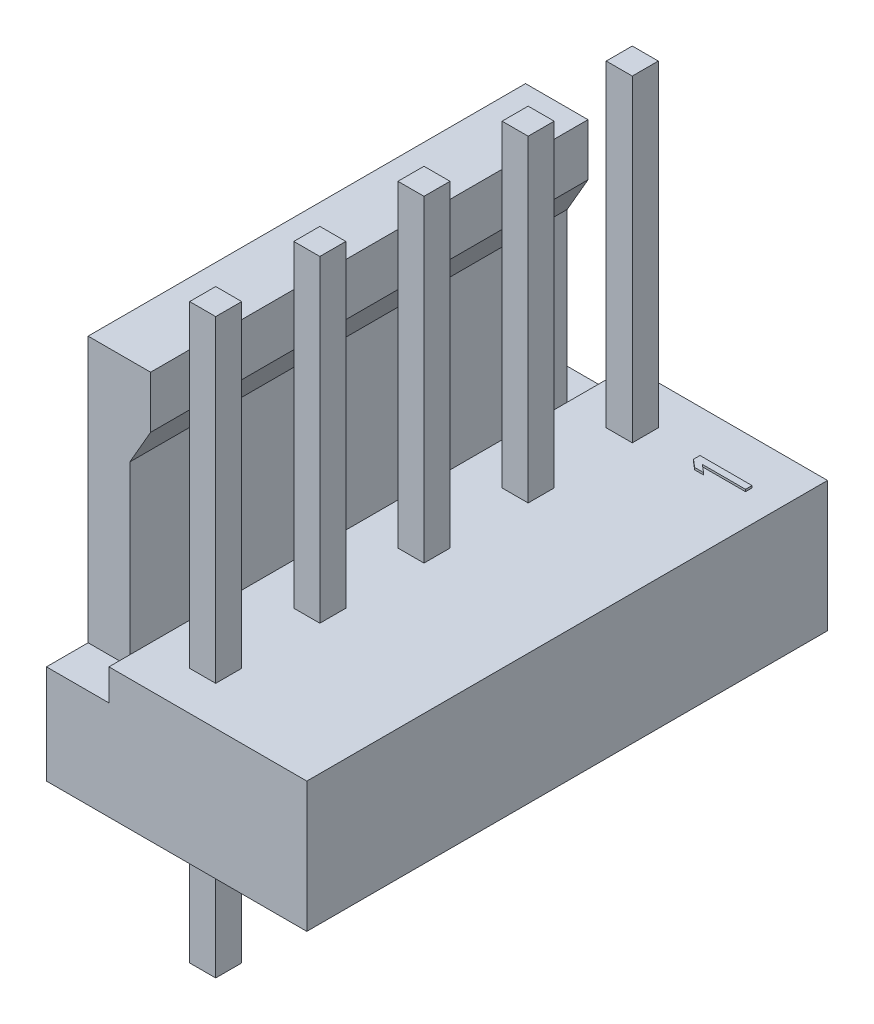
ISO-10303-21;
HEADER;
FILE_DESCRIPTION(('STEP AP214'),'2;1');
FILE_NAME('part.step','',(''),(''),'','','');
FILE_SCHEMA(('AUTOMOTIVE_DESIGN { 1 0 10303 214 1 1 1 1 }'));
ENDSEC;
DATA;
#1=APPLICATION_CONTEXT('core data for automotive mechanical design processes');
#2=APPLICATION_PROTOCOL_DEFINITION('international standard','automotive_design',2000,#1);
#3=PRODUCT_CONTEXT('',#1,'mechanical');
#4=PRODUCT('Part','Part','',(#3));
#5=PRODUCT_RELATED_PRODUCT_CATEGORY('part','',(#4));
#6=PRODUCT_DEFINITION_FORMATION('','',#4);
#7=PRODUCT_DEFINITION_CONTEXT('part definition',#1,'design');
#8=PRODUCT_DEFINITION('design','',#6,#7);
#9=PRODUCT_DEFINITION_SHAPE('','',#8);
#10=(LENGTH_UNIT() NAMED_UNIT(*) SI_UNIT(.MILLI.,.METRE.));
#11=(NAMED_UNIT(*) PLANE_ANGLE_UNIT() SI_UNIT($,.RADIAN.));
#12=(NAMED_UNIT(*) SI_UNIT($,.STERADIAN.) SOLID_ANGLE_UNIT());
#13=UNCERTAINTY_MEASURE_WITH_UNIT(LENGTH_MEASURE(1.E-05),#10,'distance_accuracy_value','');
#14=(GEOMETRIC_REPRESENTATION_CONTEXT(3) GLOBAL_UNCERTAINTY_ASSIGNED_CONTEXT((#13)) GLOBAL_UNIT_ASSIGNED_CONTEXT((#10,
#11,#12)) REPRESENTATION_CONTEXT('',''));
#15=CARTESIAN_POINT('',(0.,0.,0.));
#16=DIRECTION('',(0.,0.,1.));
#17=DIRECTION('',(1.,0.,0.));
#18=AXIS2_PLACEMENT_3D('',#15,#16,#17);
#19=CARTESIAN_POINT('',(51.8040484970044,8.24341757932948,-19.00936));
#20=DIRECTION('',(0.866025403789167,-0.49999999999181,0.));
#21=DIRECTION('',(0.49999999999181,0.866025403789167,0.));
#22=AXIS2_PLACEMENT_3D('',#19,#20,#21);
#23=PLANE('',#22);
#24=DIRECTION('',(-0.49999999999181,-0.866025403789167,0.));
#25=VECTOR('',#24,1.);
#26=CARTESIAN_POINT('',(52.07,8.70405909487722,-8.128));
#27=LINE('',#26,#25);
#28=CARTESIAN_POINT('',(52.3239999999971,9.14399999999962,-8.128));
#29=VERTEX_POINT('',#28);
#30=CARTESIAN_POINT('',(51.8160000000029,8.26411818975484,-8.128));
#31=VERTEX_POINT('',#30);
#32=EDGE_CURVE('E756',#29,#31,#27,.T.);
#33=ORIENTED_EDGE('',*,*,#32,.T.);
#34=DIRECTION('',(0.,0.,1.));
#35=VECTOR('',#34,1.);
#36=CARTESIAN_POINT('',(51.816,8.26411818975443,-13.462));
#37=LINE('',#36,#35);
#38=CARTESIAN_POINT('',(51.8160000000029,8.26411818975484,-18.796));
#39=VERTEX_POINT('',#38);
#40=EDGE_CURVE('E734',#39,#31,#37,.T.);
#41=ORIENTED_EDGE('',*,*,#40,.F.);
#42=DIRECTION('',(0.49999999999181,0.866025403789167,0.));
#43=VECTOR('',#42,1.);
#44=CARTESIAN_POINT('',(52.07,8.70405909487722,-18.796));
#45=LINE('',#44,#43);
#46=CARTESIAN_POINT('',(52.3239999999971,9.14399999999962,-18.796));
#47=VERTEX_POINT('',#46);
#48=EDGE_CURVE('E414',#39,#47,#45,.T.);
#49=ORIENTED_EDGE('',*,*,#48,.T.);
#50=DIRECTION('',(0.,0.,-1.));
#51=VECTOR('',#50,1.);
#52=CARTESIAN_POINT('',(52.324,9.144,-13.462));
#53=LINE('',#52,#51);
#54=EDGE_CURVE('E731',#29,#47,#53,.T.);
#55=ORIENTED_EDGE('',*,*,#54,.F.);
#56=EDGE_LOOP('',(#33,#41,#49,#55));
#57=FACE_BOUND('',#56,.T.);
#58=ADVANCED_FACE('F16',(#57),#23,.T.);
#59=CARTESIAN_POINT('',(53.975,12.7254,-8.7234030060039));
#60=DIRECTION('',(1.,0.,0.));
#61=DIRECTION('',(0.,0.,1.));
#62=AXIS2_PLACEMENT_3D('',#59,#60,#61);
#63=PLANE('',#62);
#64=DIRECTION('',(0.,0.,1.));
#65=VECTOR('',#64,1.);
#66=CARTESIAN_POINT('',(53.9749999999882,-1.524,-8.382));
#67=LINE('',#66,#65);
#68=CARTESIAN_POINT('',(53.9749999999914,-1.524,-8.69950000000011));
#69=VERTEX_POINT('',#68);
#70=CARTESIAN_POINT('',(53.9749999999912,-1.524,-8.06449999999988));
#71=VERTEX_POINT('',#70);
#72=EDGE_CURVE('E722',#69,#71,#67,.T.);
#73=ORIENTED_EDGE('',*,*,#72,.F.);
#74=DIRECTION('',(0.,-1.,0.));
#75=VECTOR('',#74,1.);
#76=CARTESIAN_POINT('',(53.9749999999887,5.461,-8.6995));
#77=LINE('',#76,#75);
#78=CARTESIAN_POINT('',(53.9749999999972,1.524,-8.69950000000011));
#79=VERTEX_POINT('',#78);
#80=EDGE_CURVE('E727',#79,#69,#77,.T.);
#81=ORIENTED_EDGE('',*,*,#80,.F.);
#82=DIRECTION('',(0.,0.,1.));
#83=VECTOR('',#82,1.);
#84=CARTESIAN_POINT('',(53.975,1.524,-8.382));
#85=LINE('',#84,#83);
#86=CARTESIAN_POINT('',(53.9749999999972,1.524,-8.06449999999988));
#87=VERTEX_POINT('',#86);
#88=EDGE_CURVE('E755',#79,#87,#85,.T.);
#89=ORIENTED_EDGE('',*,*,#88,.T.);
#90=DIRECTION('',(0.,1.,0.));
#91=VECTOR('',#90,1.);
#92=CARTESIAN_POINT('',(53.9749999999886,5.461,-8.0645));
#93=LINE('',#92,#91);
#94=EDGE_CURVE('E714',#71,#87,#93,.T.);
#95=ORIENTED_EDGE('',*,*,#94,.F.);
#96=EDGE_LOOP('',(#73,#81,#89,#95));
#97=FACE_BOUND('',#96,.T.);
#98=ADVANCED_FACE('F1139',(#97),#63,.T.);
#99=CARTESIAN_POINT('',(53.975,12.7254,-11.2634030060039));
#100=DIRECTION('',(1.,0.,0.));
#101=DIRECTION('',(0.,0.,1.));
#102=AXIS2_PLACEMENT_3D('',#99,#100,#101);
#103=PLANE('',#102);
#104=DIRECTION('',(0.,0.,1.));
#105=VECTOR('',#104,1.);
#106=CARTESIAN_POINT('',(53.9749999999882,-1.524,-10.922));
#107=LINE('',#106,#105);
#108=CARTESIAN_POINT('',(53.9749999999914,-1.524,-11.2395000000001));
#109=VERTEX_POINT('',#108);
#110=CARTESIAN_POINT('',(53.9749999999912,-1.524,-10.6044999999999));
#111=VERTEX_POINT('',#110);
#112=EDGE_CURVE('E705',#109,#111,#107,.T.);
#113=ORIENTED_EDGE('',*,*,#112,.F.);
#114=DIRECTION('',(0.,-1.,0.));
#115=VECTOR('',#114,1.);
#116=CARTESIAN_POINT('',(53.9749999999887,5.461,-11.2395));
#117=LINE('',#116,#115);
#118=CARTESIAN_POINT('',(53.9749999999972,1.524,-11.2395000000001));
#119=VERTEX_POINT('',#118);
#120=EDGE_CURVE('E710',#119,#109,#117,.T.);
#121=ORIENTED_EDGE('',*,*,#120,.F.);
#122=DIRECTION('',(0.,0.,1.));
#123=VECTOR('',#122,1.);
#124=CARTESIAN_POINT('',(53.975,1.524,-10.922));
#125=LINE('',#124,#123);
#126=CARTESIAN_POINT('',(53.9749999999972,1.524,-10.6044999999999));
#127=VERTEX_POINT('',#126);
#128=EDGE_CURVE('E753',#119,#127,#125,.T.);
#129=ORIENTED_EDGE('',*,*,#128,.T.);
#130=DIRECTION('',(0.,1.,0.));
#131=VECTOR('',#130,1.);
#132=CARTESIAN_POINT('',(53.9749999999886,5.461,-10.6045));
#133=LINE('',#132,#131);
#134=EDGE_CURVE('E697',#111,#127,#133,.T.);
#135=ORIENTED_EDGE('',*,*,#134,.F.);
#136=EDGE_LOOP('',(#113,#121,#129,#135));
#137=FACE_BOUND('',#136,.T.);
#138=ADVANCED_FACE('F1135',(#137),#103,.T.);
#139=CARTESIAN_POINT('',(53.975,12.7254,-13.8034030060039));
#140=DIRECTION('',(1.,0.,0.));
#141=DIRECTION('',(0.,0.,1.));
#142=AXIS2_PLACEMENT_3D('',#139,#140,#141);
#143=PLANE('',#142);
#144=DIRECTION('',(0.,0.,1.));
#145=VECTOR('',#144,1.);
#146=CARTESIAN_POINT('',(53.9749999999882,-1.524,-13.462));
#147=LINE('',#146,#145);
#148=CARTESIAN_POINT('',(53.9749999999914,-1.524,-13.7795000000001));
#149=VERTEX_POINT('',#148);
#150=CARTESIAN_POINT('',(53.9749999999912,-1.524,-13.1444999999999));
#151=VERTEX_POINT('',#150);
#152=EDGE_CURVE('E688',#149,#151,#147,.T.);
#153=ORIENTED_EDGE('',*,*,#152,.F.);
#154=DIRECTION('',(0.,-1.,0.));
#155=VECTOR('',#154,1.);
#156=CARTESIAN_POINT('',(53.9749999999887,5.461,-13.7795));
#157=LINE('',#156,#155);
#158=CARTESIAN_POINT('',(53.9749999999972,1.524,-13.7795000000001));
#159=VERTEX_POINT('',#158);
#160=EDGE_CURVE('E693',#159,#149,#157,.T.);
#161=ORIENTED_EDGE('',*,*,#160,.F.);
#162=DIRECTION('',(0.,0.,1.));
#163=VECTOR('',#162,1.);
#164=CARTESIAN_POINT('',(53.975,1.524,-13.462));
#165=LINE('',#164,#163);
#166=CARTESIAN_POINT('',(53.9749999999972,1.524,-13.1444999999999));
#167=VERTEX_POINT('',#166);
#168=EDGE_CURVE('E751',#159,#167,#165,.T.);
#169=ORIENTED_EDGE('',*,*,#168,.T.);
#170=DIRECTION('',(0.,1.,0.));
#171=VECTOR('',#170,1.);
#172=CARTESIAN_POINT('',(53.9749999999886,5.461,-13.1445));
#173=LINE('',#172,#171);
#174=EDGE_CURVE('E680',#151,#167,#173,.T.);
#175=ORIENTED_EDGE('',*,*,#174,.F.);
#176=EDGE_LOOP('',(#153,#161,#169,#175));
#177=FACE_BOUND('',#176,.T.);
#178=ADVANCED_FACE('F1131',(#177),#143,.T.);
#179=CARTESIAN_POINT('',(53.975,12.7254,-16.3434030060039));
#180=DIRECTION('',(1.,0.,0.));
#181=DIRECTION('',(0.,0.,1.));
#182=AXIS2_PLACEMENT_3D('',#179,#180,#181);
#183=PLANE('',#182);
#184=DIRECTION('',(0.,0.,1.));
#185=VECTOR('',#184,1.);
#186=CARTESIAN_POINT('',(53.9749999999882,-1.524,-16.002));
#187=LINE('',#186,#185);
#188=CARTESIAN_POINT('',(53.9749999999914,-1.524,-16.3195000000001));
#189=VERTEX_POINT('',#188);
#190=CARTESIAN_POINT('',(53.9749999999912,-1.524,-15.6844999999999));
#191=VERTEX_POINT('',#190);
#192=EDGE_CURVE('E671',#189,#191,#187,.T.);
#193=ORIENTED_EDGE('',*,*,#192,.F.);
#194=DIRECTION('',(0.,-1.,0.));
#195=VECTOR('',#194,1.);
#196=CARTESIAN_POINT('',(53.9749999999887,5.461,-16.3195));
#197=LINE('',#196,#195);
#198=CARTESIAN_POINT('',(53.9749999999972,1.524,-16.3195000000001));
#199=VERTEX_POINT('',#198);
#200=EDGE_CURVE('E676',#199,#189,#197,.T.);
#201=ORIENTED_EDGE('',*,*,#200,.F.);
#202=DIRECTION('',(0.,0.,1.));
#203=VECTOR('',#202,1.);
#204=CARTESIAN_POINT('',(53.975,1.524,-16.002));
#205=LINE('',#204,#203);
#206=CARTESIAN_POINT('',(53.9749999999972,1.524,-15.6844999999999));
#207=VERTEX_POINT('',#206);
#208=EDGE_CURVE('E749',#199,#207,#205,.T.);
#209=ORIENTED_EDGE('',*,*,#208,.T.);
#210=DIRECTION('',(0.,1.,0.));
#211=VECTOR('',#210,1.);
#212=CARTESIAN_POINT('',(53.9749999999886,5.461,-15.6845));
#213=LINE('',#212,#211);
#214=EDGE_CURVE('E663',#191,#207,#213,.T.);
#215=ORIENTED_EDGE('',*,*,#214,.F.);
#216=EDGE_LOOP('',(#193,#201,#209,#215));
#217=FACE_BOUND('',#216,.T.);
#218=ADVANCED_FACE('F1127',(#217),#183,.T.);
#219=CARTESIAN_POINT('',(53.975,12.7254,-18.8834030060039));
#220=DIRECTION('',(1.,0.,0.));
#221=DIRECTION('',(0.,0.,1.));
#222=AXIS2_PLACEMENT_3D('',#219,#220,#221);
#223=PLANE('',#222);
#224=DIRECTION('',(0.,0.,1.));
#225=VECTOR('',#224,1.);
#226=CARTESIAN_POINT('',(53.9749999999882,-1.524,-18.542));
#227=LINE('',#226,#225);
#228=CARTESIAN_POINT('',(53.9749999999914,-1.524,-18.8595000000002));
#229=VERTEX_POINT('',#228);
#230=CARTESIAN_POINT('',(53.9749999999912,-1.524,-18.2244999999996));
#231=VERTEX_POINT('',#230);
#232=EDGE_CURVE('E654',#229,#231,#227,.T.);
#233=ORIENTED_EDGE('',*,*,#232,.F.);
#234=DIRECTION('',(0.,-1.,0.));
#235=VECTOR('',#234,1.);
#236=CARTESIAN_POINT('',(53.9749999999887,5.461,-18.8595));
#237=LINE('',#236,#235);
#238=CARTESIAN_POINT('',(53.9749999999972,1.524,-18.8595000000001));
#239=VERTEX_POINT('',#238);
#240=EDGE_CURVE('E659',#239,#229,#237,.T.);
#241=ORIENTED_EDGE('',*,*,#240,.F.);
#242=DIRECTION('',(0.,0.,1.));
#243=VECTOR('',#242,1.);
#244=CARTESIAN_POINT('',(53.975,1.524,-18.542));
#245=LINE('',#244,#243);
#246=CARTESIAN_POINT('',(53.9749999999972,1.524,-18.2244999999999));
#247=VERTEX_POINT('',#246);
#248=EDGE_CURVE('E747',#239,#247,#245,.T.);
#249=ORIENTED_EDGE('',*,*,#248,.T.);
#250=DIRECTION('',(0.,1.,0.));
#251=VECTOR('',#250,1.);
#252=CARTESIAN_POINT('',(53.9749999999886,5.461,-18.2245));
#253=LINE('',#252,#251);
#254=EDGE_CURVE('E646',#231,#247,#253,.T.);
#255=ORIENTED_EDGE('',*,*,#254,.F.);
#256=EDGE_LOOP('',(#233,#241,#249,#255));
#257=FACE_BOUND('',#256,.T.);
#258=ADVANCED_FACE('F1123',(#257),#223,.T.);
#259=CARTESIAN_POINT('',(53.34,12.7254,-8.0405969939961));
#260=DIRECTION('',(-1.,0.,0.));
#261=DIRECTION('',(0.,0.,-1.));
#262=AXIS2_PLACEMENT_3D('',#259,#260,#261);
#263=PLANE('',#262);
#264=DIRECTION('',(0.,0.,-1.));
#265=VECTOR('',#264,1.);
#266=CARTESIAN_POINT('',(53.3400000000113,12.446,-8.382));
#267=LINE('',#266,#265);
#268=CARTESIAN_POINT('',(53.3400000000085,12.446,-8.06449999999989));
#269=VERTEX_POINT('',#268);
#270=CARTESIAN_POINT('',(53.3400000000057,12.446,-8.69950000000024));
#271=VERTEX_POINT('',#270);
#272=EDGE_CURVE('E629',#269,#271,#267,.T.);
#273=ORIENTED_EDGE('',*,*,#272,.T.);
#274=DIRECTION('',(0.,1.,0.));
#275=VECTOR('',#274,1.);
#276=CARTESIAN_POINT('',(53.3400000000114,5.461,-8.6995));
#277=LINE('',#276,#275);
#278=CARTESIAN_POINT('',(53.3400000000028,4.699,-8.69950000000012));
#279=VERTEX_POINT('',#278);
#280=EDGE_CURVE('E632',#279,#271,#277,.T.);
#281=ORIENTED_EDGE('',*,*,#280,.F.);
#282=DIRECTION('',(0.,0.,1.));
#283=VECTOR('',#282,1.);
#284=CARTESIAN_POINT('',(53.34,4.699,-8.382));
#285=LINE('',#284,#283);
#286=CARTESIAN_POINT('',(53.3400000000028,4.699,-8.06449999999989));
#287=VERTEX_POINT('',#286);
#288=EDGE_CURVE('E745',#279,#287,#285,.T.);
#289=ORIENTED_EDGE('',*,*,#288,.T.);
#290=DIRECTION('',(0.,-1.,0.));
#291=VECTOR('',#290,1.);
#292=CARTESIAN_POINT('',(53.3400000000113,5.461,-8.0645));
#293=LINE('',#292,#291);
#294=EDGE_CURVE('E618',#269,#287,#293,.T.);
#295=ORIENTED_EDGE('',*,*,#294,.F.);
#296=EDGE_LOOP('',(#273,#281,#289,#295));
#297=FACE_BOUND('',#296,.T.);
#298=ADVANCED_FACE('F1119',(#297),#263,.T.);
#299=CARTESIAN_POINT('',(53.34,12.7254,-10.5805969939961));
#300=DIRECTION('',(-1.,0.,0.));
#301=DIRECTION('',(0.,0.,-1.));
#302=AXIS2_PLACEMENT_3D('',#299,#300,#301);
#303=PLANE('',#302);
#304=DIRECTION('',(0.,0.,-1.));
#305=VECTOR('',#304,1.);
#306=CARTESIAN_POINT('',(53.3400000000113,12.446,-10.922));
#307=LINE('',#306,#305);
#308=CARTESIAN_POINT('',(53.3400000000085,12.446,-10.6044999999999));
#309=VERTEX_POINT('',#308);
#310=CARTESIAN_POINT('',(53.3400000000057,12.446,-11.2395000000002));
#311=VERTEX_POINT('',#310);
#312=EDGE_CURVE('E611',#309,#311,#307,.T.);
#313=ORIENTED_EDGE('',*,*,#312,.T.);
#314=DIRECTION('',(0.,1.,0.));
#315=VECTOR('',#314,1.);
#316=CARTESIAN_POINT('',(53.3400000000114,5.461,-11.2395));
#317=LINE('',#316,#315);
#318=CARTESIAN_POINT('',(53.3400000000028,4.699,-11.2395000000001));
#319=VERTEX_POINT('',#318);
#320=EDGE_CURVE('E614',#319,#311,#317,.T.);
#321=ORIENTED_EDGE('',*,*,#320,.F.);
#322=DIRECTION('',(0.,0.,1.));
#323=VECTOR('',#322,1.);
#324=CARTESIAN_POINT('',(53.34,4.699,-10.922));
#325=LINE('',#324,#323);
#326=CARTESIAN_POINT('',(53.3400000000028,4.699,-10.6044999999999));
#327=VERTEX_POINT('',#326);
#328=EDGE_CURVE('E743',#319,#327,#325,.T.);
#329=ORIENTED_EDGE('',*,*,#328,.T.);
#330=DIRECTION('',(0.,-1.,0.));
#331=VECTOR('',#330,1.);
#332=CARTESIAN_POINT('',(53.3400000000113,5.461,-10.6045));
#333=LINE('',#332,#331);
#334=EDGE_CURVE('E600',#309,#327,#333,.T.);
#335=ORIENTED_EDGE('',*,*,#334,.F.);
#336=EDGE_LOOP('',(#313,#321,#329,#335));
#337=FACE_BOUND('',#336,.T.);
#338=ADVANCED_FACE('F1115',(#337),#303,.T.);
#339=CARTESIAN_POINT('',(53.34,12.7254,-13.1205969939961));
#340=DIRECTION('',(-1.,0.,0.));
#341=DIRECTION('',(0.,0.,-1.));
#342=AXIS2_PLACEMENT_3D('',#339,#340,#341);
#343=PLANE('',#342);
#344=DIRECTION('',(0.,0.,-1.));
#345=VECTOR('',#344,1.);
#346=CARTESIAN_POINT('',(53.3400000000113,12.446,-13.462));
#347=LINE('',#346,#345);
#348=CARTESIAN_POINT('',(53.3400000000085,12.446,-13.1444999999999));
#349=VERTEX_POINT('',#348);
#350=CARTESIAN_POINT('',(53.3400000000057,12.446,-13.7795000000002));
#351=VERTEX_POINT('',#350);
#352=EDGE_CURVE('E593',#349,#351,#347,.T.);
#353=ORIENTED_EDGE('',*,*,#352,.T.);
#354=DIRECTION('',(0.,1.,0.));
#355=VECTOR('',#354,1.);
#356=CARTESIAN_POINT('',(53.3400000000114,5.461,-13.7795));
#357=LINE('',#356,#355);
#358=CARTESIAN_POINT('',(53.3400000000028,4.699,-13.7795000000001));
#359=VERTEX_POINT('',#358);
#360=EDGE_CURVE('E596',#359,#351,#357,.T.);
#361=ORIENTED_EDGE('',*,*,#360,.F.);
#362=DIRECTION('',(0.,0.,1.));
#363=VECTOR('',#362,1.);
#364=CARTESIAN_POINT('',(53.34,4.699,-13.462));
#365=LINE('',#364,#363);
#366=CARTESIAN_POINT('',(53.3400000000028,4.699,-13.1444999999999));
#367=VERTEX_POINT('',#366);
#368=EDGE_CURVE('E741',#359,#367,#365,.T.);
#369=ORIENTED_EDGE('',*,*,#368,.T.);
#370=DIRECTION('',(0.,-1.,0.));
#371=VECTOR('',#370,1.);
#372=CARTESIAN_POINT('',(53.3400000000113,5.461,-13.1445));
#373=LINE('',#372,#371);
#374=EDGE_CURVE('E582',#349,#367,#373,.T.);
#375=ORIENTED_EDGE('',*,*,#374,.F.);
#376=EDGE_LOOP('',(#353,#361,#369,#375));
#377=FACE_BOUND('',#376,.T.);
#378=ADVANCED_FACE('F1111',(#377),#343,.T.);
#379=CARTESIAN_POINT('',(53.34,12.7254,-15.6605969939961));
#380=DIRECTION('',(-1.,0.,0.));
#381=DIRECTION('',(0.,0.,-1.));
#382=AXIS2_PLACEMENT_3D('',#379,#380,#381);
#383=PLANE('',#382);
#384=DIRECTION('',(0.,0.,-1.));
#385=VECTOR('',#384,1.);
#386=CARTESIAN_POINT('',(53.3400000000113,12.446,-16.002));
#387=LINE('',#386,#385);
#388=CARTESIAN_POINT('',(53.3400000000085,12.446,-15.6844999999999));
#389=VERTEX_POINT('',#388);
#390=CARTESIAN_POINT('',(53.3400000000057,12.446,-16.3195000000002));
#391=VERTEX_POINT('',#390);
#392=EDGE_CURVE('E575',#389,#391,#387,.T.);
#393=ORIENTED_EDGE('',*,*,#392,.T.);
#394=DIRECTION('',(0.,1.,0.));
#395=VECTOR('',#394,1.);
#396=CARTESIAN_POINT('',(53.3400000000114,5.461,-16.3195));
#397=LINE('',#396,#395);
#398=CARTESIAN_POINT('',(53.3400000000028,4.699,-16.3195000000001));
#399=VERTEX_POINT('',#398);
#400=EDGE_CURVE('E578',#399,#391,#397,.T.);
#401=ORIENTED_EDGE('',*,*,#400,.F.);
#402=DIRECTION('',(0.,0.,1.));
#403=VECTOR('',#402,1.);
#404=CARTESIAN_POINT('',(53.34,4.699,-16.002));
#405=LINE('',#404,#403);
#406=CARTESIAN_POINT('',(53.3400000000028,4.699,-15.6844999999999));
#407=VERTEX_POINT('',#406);
#408=EDGE_CURVE('E739',#399,#407,#405,.T.);
#409=ORIENTED_EDGE('',*,*,#408,.T.);
#410=DIRECTION('',(0.,-1.,0.));
#411=VECTOR('',#410,1.);
#412=CARTESIAN_POINT('',(53.3400000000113,5.461,-15.6845));
#413=LINE('',#412,#411);
#414=EDGE_CURVE('E564',#389,#407,#413,.T.);
#415=ORIENTED_EDGE('',*,*,#414,.F.);
#416=EDGE_LOOP('',(#393,#401,#409,#415));
#417=FACE_BOUND('',#416,.T.);
#418=ADVANCED_FACE('F1107',(#417),#383,.T.);
#419=CARTESIAN_POINT('',(53.34,12.7254,-18.2005969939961));
#420=DIRECTION('',(-1.,0.,0.));
#421=DIRECTION('',(0.,0.,-1.));
#422=AXIS2_PLACEMENT_3D('',#419,#420,#421);
#423=PLANE('',#422);
#424=DIRECTION('',(0.,0.,-1.));
#425=VECTOR('',#424,1.);
#426=CARTESIAN_POINT('',(53.3400000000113,12.446,-18.542));
#427=LINE('',#426,#425);
#428=CARTESIAN_POINT('',(53.3400000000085,12.446,-18.2244999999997));
#429=VERTEX_POINT('',#428);
#430=CARTESIAN_POINT('',(53.3400000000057,12.446,-18.8595000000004));
#431=VERTEX_POINT('',#430);
#432=EDGE_CURVE('E557',#429,#431,#427,.T.);
#433=ORIENTED_EDGE('',*,*,#432,.T.);
#434=DIRECTION('',(0.,1.,0.));
#435=VECTOR('',#434,1.);
#436=CARTESIAN_POINT('',(53.3400000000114,5.461,-18.8595));
#437=LINE('',#436,#435);
#438=CARTESIAN_POINT('',(53.3400000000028,4.699,-18.8595000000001));
#439=VERTEX_POINT('',#438);
#440=EDGE_CURVE('E560',#439,#431,#437,.T.);
#441=ORIENTED_EDGE('',*,*,#440,.F.);
#442=DIRECTION('',(0.,0.,1.));
#443=VECTOR('',#442,1.);
#444=CARTESIAN_POINT('',(53.34,4.699,-18.542));
#445=LINE('',#444,#443);
#446=CARTESIAN_POINT('',(53.3400000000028,4.699,-18.2244999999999));
#447=VERTEX_POINT('',#446);
#448=EDGE_CURVE('E737',#439,#447,#445,.T.);
#449=ORIENTED_EDGE('',*,*,#448,.T.);
#450=DIRECTION('',(0.,-1.,0.));
#451=VECTOR('',#450,1.);
#452=CARTESIAN_POINT('',(53.3400000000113,5.461,-18.2245));
#453=LINE('',#452,#451);
#454=EDGE_CURVE('E546',#429,#447,#453,.T.);
#455=ORIENTED_EDGE('',*,*,#454,.F.);
#456=EDGE_LOOP('',(#433,#441,#449,#455));
#457=FACE_BOUND('',#456,.T.);
#458=ADVANCED_FACE('F1104',(#457),#423,.T.);
#459=CARTESIAN_POINT('',(51.816,3.8504576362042,-19.00936));
#460=DIRECTION('',(1.,0.,0.));
#461=DIRECTION('',(0.,1.,0.));
#462=AXIS2_PLACEMENT_3D('',#459,#460,#461);
#463=PLANE('',#462);
#464=DIRECTION('',(0.,1.,0.));
#465=VECTOR('',#464,1.);
#466=CARTESIAN_POINT('',(51.816,7.1755,-8.128));
#467=LINE('',#466,#465);
#468=CARTESIAN_POINT('',(51.816,3.93699999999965,-8.128));
#469=VERTEX_POINT('',#468);
#470=EDGE_CURVE('E535',#469,#31,#467,.T.);
#471=ORIENTED_EDGE('',*,*,#470,.F.);
#472=DIRECTION('',(0.,0.,1.));
#473=VECTOR('',#472,1.);
#474=CARTESIAN_POINT('',(51.816,3.937,-13.462));
#475=LINE('',#474,#473);
#476=CARTESIAN_POINT('',(51.816,3.93699999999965,-18.796));
#477=VERTEX_POINT('',#476);
#478=EDGE_CURVE('E644',#477,#469,#475,.T.);
#479=ORIENTED_EDGE('',*,*,#478,.F.);
#480=DIRECTION('',(0.,-1.,0.));
#481=VECTOR('',#480,1.);
#482=CARTESIAN_POINT('',(51.816,7.1755,-18.796));
#483=LINE('',#482,#481);
#484=EDGE_CURVE('E544',#39,#477,#483,.T.);
#485=ORIENTED_EDGE('',*,*,#484,.F.);
#486=ORIENTED_EDGE('',*,*,#40,.T.);
#487=EDGE_LOOP('',(#471,#479,#485,#486));
#488=FACE_BOUND('',#487,.T.);
#489=ADVANCED_FACE('F890',(#488),#463,.T.);
#490=CARTESIAN_POINT('',(52.324,9.1186,-19.00936));
#491=DIRECTION('',(1.,0.,0.));
#492=DIRECTION('',(0.,1.,0.));
#493=AXIS2_PLACEMENT_3D('',#490,#491,#492);
#494=PLANE('',#493);
#495=DIRECTION('',(0.,1.,0.));
#496=VECTOR('',#495,1.);
#497=CARTESIAN_POINT('',(52.324,7.1755,-8.128));
#498=LINE('',#497,#496);
#499=CARTESIAN_POINT('',(52.324,10.414,-8.128));
#500=VERTEX_POINT('',#499);
#501=EDGE_CURVE('E533',#29,#500,#498,.T.);
#502=ORIENTED_EDGE('',*,*,#501,.F.);
#503=ORIENTED_EDGE('',*,*,#54,.T.);
#504=DIRECTION('',(0.,-1.,0.));
#505=VECTOR('',#504,1.);
#506=CARTESIAN_POINT('',(52.324,7.1755,-18.796));
#507=LINE('',#506,#505);
#508=CARTESIAN_POINT('',(52.324,10.414,-18.796));
#509=VERTEX_POINT('',#508);
#510=EDGE_CURVE('E538',#509,#47,#507,.T.);
#511=ORIENTED_EDGE('',*,*,#510,.F.);
#512=DIRECTION('',(0.,0.,-1.));
#513=VECTOR('',#512,1.);
#514=CARTESIAN_POINT('',(52.324,10.414,-13.462));
#515=LINE('',#514,#513);
#516=EDGE_CURVE('E522',#500,#509,#515,.T.);
#517=ORIENTED_EDGE('',*,*,#516,.F.);
#518=EDGE_LOOP('',(#502,#503,#511,#517));
#519=FACE_BOUND('',#518,.T.);
#520=ADVANCED_FACE('F764',(#519),#494,.T.);
#521=CARTESIAN_POINT('',(53.3160969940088,12.7254,-8.6995));
#522=DIRECTION('',(0.,0.,-1.));
#523=DIRECTION('',(1.,0.,0.));
#524=AXIS2_PLACEMENT_3D('',#521,#522,#523);
#525=PLANE('',#524);
#526=DIRECTION('',(1.,0.,0.));
#527=VECTOR('',#526,1.);
#528=CARTESIAN_POINT('',(53.6575,-1.524,-8.6995));
#529=LINE('',#528,#527);
#530=CARTESIAN_POINT('',(53.3400000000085,-1.524,-8.69950000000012));
#531=VERTEX_POINT('',#530);
#532=EDGE_CURVE('E724',#531,#69,#529,.T.);
#533=ORIENTED_EDGE('',*,*,#532,.F.);
#534=DIRECTION('',(0.,-1.,0.));
#535=VECTOR('',#534,1.);
#536=CARTESIAN_POINT('',(53.34,5.461,-8.69950000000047));
#537=LINE('',#536,#535);
#538=CARTESIAN_POINT('',(53.3400000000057,1.524,-8.69950000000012));
#539=VERTEX_POINT('',#538);
#540=EDGE_CURVE('E520',#539,#531,#537,.T.);
#541=ORIENTED_EDGE('',*,*,#540,.F.);
#542=DIRECTION('',(1.,0.,0.));
#543=VECTOR('',#542,1.);
#544=CARTESIAN_POINT('',(53.6575,1.524,-8.6995));
#545=LINE('',#544,#543);
#546=EDGE_CURVE('E729',#539,#79,#545,.T.);
#547=ORIENTED_EDGE('',*,*,#546,.T.);
#548=ORIENTED_EDGE('',*,*,#80,.T.);
#549=EDGE_LOOP('',(#533,#541,#547,#548));
#550=FACE_BOUND('',#549,.T.);
#551=ADVANCED_FACE('F1095',(#550),#525,.T.);
#552=CARTESIAN_POINT('',(53.3160969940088,-1.524,-8.0405969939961));
#553=DIRECTION('',(0.,-1.,0.));
#554=DIRECTION('',(0.,0.,-1.));
#555=AXIS2_PLACEMENT_3D('',#552,#553,#554);
#556=PLANE('',#555);
#557=ORIENTED_EDGE('',*,*,#532,.T.);
#558=ORIENTED_EDGE('',*,*,#72,.T.);
#559=DIRECTION('',(1.,0.,0.));
#560=VECTOR('',#559,1.);
#561=CARTESIAN_POINT('',(53.6575,-1.524,-8.0645));
#562=LINE('',#561,#560);
#563=CARTESIAN_POINT('',(53.3400000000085,-1.524,-8.06449999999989));
#564=VERTEX_POINT('',#563);
#565=EDGE_CURVE('E717',#564,#71,#562,.T.);
#566=ORIENTED_EDGE('',*,*,#565,.F.);
#567=DIRECTION('',(0.,0.,1.));
#568=VECTOR('',#567,1.);
#569=CARTESIAN_POINT('',(53.34,-1.524,-8.382));
#570=LINE('',#569,#568);
#571=EDGE_CURVE('E518',#531,#564,#570,.T.);
#572=ORIENTED_EDGE('',*,*,#571,.F.);
#573=EDGE_LOOP('',(#557,#558,#566,#572));
#574=FACE_BOUND('',#573,.T.);
#575=ADVANCED_FACE('F1091',(#574),#556,.T.);
#576=CARTESIAN_POINT('',(53.9989030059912,12.7254,-8.0645));
#577=DIRECTION('',(0.,0.,1.));
#578=DIRECTION('',(-1.,0.,0.));
#579=AXIS2_PLACEMENT_3D('',#576,#577,#578);
#580=PLANE('',#579);
#581=ORIENTED_EDGE('',*,*,#565,.T.);
#582=ORIENTED_EDGE('',*,*,#94,.T.);
#583=DIRECTION('',(-1.,0.,0.));
#584=VECTOR('',#583,1.);
#585=CARTESIAN_POINT('',(53.6575,1.524,-8.0645));
#586=LINE('',#585,#584);
#587=CARTESIAN_POINT('',(53.3400000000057,1.524,-8.06449999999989));
#588=VERTEX_POINT('',#587);
#589=EDGE_CURVE('E720',#87,#588,#586,.T.);
#590=ORIENTED_EDGE('',*,*,#589,.T.);
#591=DIRECTION('',(0.,1.,0.));
#592=VECTOR('',#591,1.);
#593=CARTESIAN_POINT('',(53.34,5.461,-8.06449999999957));
#594=LINE('',#593,#592);
#595=EDGE_CURVE('E515',#564,#588,#594,.T.);
#596=ORIENTED_EDGE('',*,*,#595,.F.);
#597=EDGE_LOOP('',(#581,#582,#590,#596));
#598=FACE_BOUND('',#597,.T.);
#599=ADVANCED_FACE('F1087',(#598),#580,.T.);
#600=CARTESIAN_POINT('',(53.3160969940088,12.7254,-11.2395));
#601=DIRECTION('',(0.,0.,-1.));
#602=DIRECTION('',(1.,0.,0.));
#603=AXIS2_PLACEMENT_3D('',#600,#601,#602);
#604=PLANE('',#603);
#605=DIRECTION('',(1.,0.,0.));
#606=VECTOR('',#605,1.);
#607=CARTESIAN_POINT('',(53.6575,-1.524,-11.2395));
#608=LINE('',#607,#606);
#609=CARTESIAN_POINT('',(53.3400000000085,-1.524,-11.2395000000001));
#610=VERTEX_POINT('',#609);
#611=EDGE_CURVE('E707',#610,#109,#608,.T.);
#612=ORIENTED_EDGE('',*,*,#611,.F.);
#613=DIRECTION('',(0.,-1.,0.));
#614=VECTOR('',#613,1.);
#615=CARTESIAN_POINT('',(53.34,5.461,-11.2395000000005));
#616=LINE('',#615,#614);
#617=CARTESIAN_POINT('',(53.3400000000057,1.524,-11.2395000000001));
#618=VERTEX_POINT('',#617);
#619=EDGE_CURVE('E513',#618,#610,#616,.T.);
#620=ORIENTED_EDGE('',*,*,#619,.F.);
#621=DIRECTION('',(1.,0.,0.));
#622=VECTOR('',#621,1.);
#623=CARTESIAN_POINT('',(53.6575,1.524,-11.2395));
#624=LINE('',#623,#622);
#625=EDGE_CURVE('E712',#618,#119,#624,.T.);
#626=ORIENTED_EDGE('',*,*,#625,.T.);
#627=ORIENTED_EDGE('',*,*,#120,.T.);
#628=EDGE_LOOP('',(#612,#620,#626,#627));
#629=FACE_BOUND('',#628,.T.);
#630=ADVANCED_FACE('F1083',(#629),#604,.T.);
#631=CARTESIAN_POINT('',(53.3160969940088,-1.524,-10.5805969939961));
#632=DIRECTION('',(0.,-1.,0.));
#633=DIRECTION('',(0.,0.,-1.));
#634=AXIS2_PLACEMENT_3D('',#631,#632,#633);
#635=PLANE('',#634);
#636=ORIENTED_EDGE('',*,*,#611,.T.);
#637=ORIENTED_EDGE('',*,*,#112,.T.);
#638=DIRECTION('',(1.,0.,0.));
#639=VECTOR('',#638,1.);
#640=CARTESIAN_POINT('',(53.6575,-1.524,-10.6045));
#641=LINE('',#640,#639);
#642=CARTESIAN_POINT('',(53.3400000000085,-1.524,-10.6044999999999));
#643=VERTEX_POINT('',#642);
#644=EDGE_CURVE('E700',#643,#111,#641,.T.);
#645=ORIENTED_EDGE('',*,*,#644,.F.);
#646=DIRECTION('',(0.,0.,1.));
#647=VECTOR('',#646,1.);
#648=CARTESIAN_POINT('',(53.34,-1.524,-10.922));
#649=LINE('',#648,#647);
#650=EDGE_CURVE('E511',#610,#643,#649,.T.);
#651=ORIENTED_EDGE('',*,*,#650,.F.);
#652=EDGE_LOOP('',(#636,#637,#645,#651));
#653=FACE_BOUND('',#652,.T.);
#654=ADVANCED_FACE('F1079',(#653),#635,.T.);
#655=CARTESIAN_POINT('',(53.9989030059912,12.7254,-10.6045));
#656=DIRECTION('',(0.,0.,1.));
#657=DIRECTION('',(-1.,0.,0.));
#658=AXIS2_PLACEMENT_3D('',#655,#656,#657);
#659=PLANE('',#658);
#660=ORIENTED_EDGE('',*,*,#644,.T.);
#661=ORIENTED_EDGE('',*,*,#134,.T.);
#662=DIRECTION('',(-1.,0.,0.));
#663=VECTOR('',#662,1.);
#664=CARTESIAN_POINT('',(53.6575,1.524,-10.6045));
#665=LINE('',#664,#663);
#666=CARTESIAN_POINT('',(53.3400000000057,1.524,-10.6044999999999));
#667=VERTEX_POINT('',#666);
#668=EDGE_CURVE('E703',#127,#667,#665,.T.);
#669=ORIENTED_EDGE('',*,*,#668,.T.);
#670=DIRECTION('',(0.,1.,0.));
#671=VECTOR('',#670,1.);
#672=CARTESIAN_POINT('',(53.34,5.461,-10.6044999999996));
#673=LINE('',#672,#671);
#674=EDGE_CURVE('E508',#643,#667,#673,.T.);
#675=ORIENTED_EDGE('',*,*,#674,.F.);
#676=EDGE_LOOP('',(#660,#661,#669,#675));
#677=FACE_BOUND('',#676,.T.);
#678=ADVANCED_FACE('F1075',(#677),#659,.T.);
#679=CARTESIAN_POINT('',(53.3160969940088,12.7254,-13.7795));
#680=DIRECTION('',(0.,0.,-1.));
#681=DIRECTION('',(1.,0.,0.));
#682=AXIS2_PLACEMENT_3D('',#679,#680,#681);
#683=PLANE('',#682);
#684=DIRECTION('',(1.,0.,0.));
#685=VECTOR('',#684,1.);
#686=CARTESIAN_POINT('',(53.6575,-1.524,-13.7795));
#687=LINE('',#686,#685);
#688=CARTESIAN_POINT('',(53.3400000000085,-1.524,-13.7795000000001));
#689=VERTEX_POINT('',#688);
#690=EDGE_CURVE('E690',#689,#149,#687,.T.);
#691=ORIENTED_EDGE('',*,*,#690,.F.);
#692=DIRECTION('',(0.,-1.,0.));
#693=VECTOR('',#692,1.);
#694=CARTESIAN_POINT('',(53.34,5.461,-13.7795000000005));
#695=LINE('',#694,#693);
#696=CARTESIAN_POINT('',(53.3400000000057,1.524,-13.7795000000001));
#697=VERTEX_POINT('',#696);
#698=EDGE_CURVE('E506',#697,#689,#695,.T.);
#699=ORIENTED_EDGE('',*,*,#698,.F.);
#700=DIRECTION('',(1.,0.,0.));
#701=VECTOR('',#700,1.);
#702=CARTESIAN_POINT('',(53.6575,1.524,-13.7795));
#703=LINE('',#702,#701);
#704=EDGE_CURVE('E695',#697,#159,#703,.T.);
#705=ORIENTED_EDGE('',*,*,#704,.T.);
#706=ORIENTED_EDGE('',*,*,#160,.T.);
#707=EDGE_LOOP('',(#691,#699,#705,#706));
#708=FACE_BOUND('',#707,.T.);
#709=ADVANCED_FACE('F1071',(#708),#683,.T.);
#710=CARTESIAN_POINT('',(53.3160969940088,-1.524,-13.1205969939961));
#711=DIRECTION('',(0.,-1.,0.));
#712=DIRECTION('',(0.,0.,-1.));
#713=AXIS2_PLACEMENT_3D('',#710,#711,#712);
#714=PLANE('',#713);
#715=ORIENTED_EDGE('',*,*,#690,.T.);
#716=ORIENTED_EDGE('',*,*,#152,.T.);
#717=DIRECTION('',(1.,0.,0.));
#718=VECTOR('',#717,1.);
#719=CARTESIAN_POINT('',(53.6575,-1.524,-13.1445));
#720=LINE('',#719,#718);
#721=CARTESIAN_POINT('',(53.3400000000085,-1.524,-13.1444999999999));
#722=VERTEX_POINT('',#721);
#723=EDGE_CURVE('E683',#722,#151,#720,.T.);
#724=ORIENTED_EDGE('',*,*,#723,.F.);
#725=DIRECTION('',(0.,0.,1.));
#726=VECTOR('',#725,1.);
#727=CARTESIAN_POINT('',(53.34,-1.524,-13.462));
#728=LINE('',#727,#726);
#729=EDGE_CURVE('E504',#689,#722,#728,.T.);
#730=ORIENTED_EDGE('',*,*,#729,.F.);
#731=EDGE_LOOP('',(#715,#716,#724,#730));
#732=FACE_BOUND('',#731,.T.);
#733=ADVANCED_FACE('F1067',(#732),#714,.T.);
#734=CARTESIAN_POINT('',(53.9989030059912,12.7254,-13.1445));
#735=DIRECTION('',(0.,0.,1.));
#736=DIRECTION('',(-1.,0.,0.));
#737=AXIS2_PLACEMENT_3D('',#734,#735,#736);
#738=PLANE('',#737);
#739=ORIENTED_EDGE('',*,*,#723,.T.);
#740=ORIENTED_EDGE('',*,*,#174,.T.);
#741=DIRECTION('',(-1.,0.,0.));
#742=VECTOR('',#741,1.);
#743=CARTESIAN_POINT('',(53.6575,1.524,-13.1445));
#744=LINE('',#743,#742);
#745=CARTESIAN_POINT('',(53.3400000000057,1.524,-13.1444999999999));
#746=VERTEX_POINT('',#745);
#747=EDGE_CURVE('E686',#167,#746,#744,.T.);
#748=ORIENTED_EDGE('',*,*,#747,.T.);
#749=DIRECTION('',(0.,1.,0.));
#750=VECTOR('',#749,1.);
#751=CARTESIAN_POINT('',(53.34,5.461,-13.1444999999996));
#752=LINE('',#751,#750);
#753=EDGE_CURVE('E501',#722,#746,#752,.T.);
#754=ORIENTED_EDGE('',*,*,#753,.F.);
#755=EDGE_LOOP('',(#739,#740,#748,#754));
#756=FACE_BOUND('',#755,.T.);
#757=ADVANCED_FACE('F1063',(#756),#738,.T.);
#758=CARTESIAN_POINT('',(53.3160969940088,12.7254,-16.3195));
#759=DIRECTION('',(0.,0.,-1.));
#760=DIRECTION('',(1.,0.,0.));
#761=AXIS2_PLACEMENT_3D('',#758,#759,#760);
#762=PLANE('',#761);
#763=DIRECTION('',(1.,0.,0.));
#764=VECTOR('',#763,1.);
#765=CARTESIAN_POINT('',(53.6575,-1.524,-16.3195));
#766=LINE('',#765,#764);
#767=CARTESIAN_POINT('',(53.3400000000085,-1.524,-16.3195000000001));
#768=VERTEX_POINT('',#767);
#769=EDGE_CURVE('E673',#768,#189,#766,.T.);
#770=ORIENTED_EDGE('',*,*,#769,.F.);
#771=DIRECTION('',(0.,-1.,0.));
#772=VECTOR('',#771,1.);
#773=CARTESIAN_POINT('',(53.34,5.461,-16.3195000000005));
#774=LINE('',#773,#772);
#775=CARTESIAN_POINT('',(53.3400000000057,1.524,-16.3195000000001));
#776=VERTEX_POINT('',#775);
#777=EDGE_CURVE('E499',#776,#768,#774,.T.);
#778=ORIENTED_EDGE('',*,*,#777,.F.);
#779=DIRECTION('',(1.,0.,0.));
#780=VECTOR('',#779,1.);
#781=CARTESIAN_POINT('',(53.6575,1.524,-16.3195));
#782=LINE('',#781,#780);
#783=EDGE_CURVE('E678',#776,#199,#782,.T.);
#784=ORIENTED_EDGE('',*,*,#783,.T.);
#785=ORIENTED_EDGE('',*,*,#200,.T.);
#786=EDGE_LOOP('',(#770,#778,#784,#785));
#787=FACE_BOUND('',#786,.T.);
#788=ADVANCED_FACE('F1059',(#787),#762,.T.);
#789=CARTESIAN_POINT('',(53.3160969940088,-1.524,-15.6605969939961));
#790=DIRECTION('',(0.,-1.,0.));
#791=DIRECTION('',(0.,0.,-1.));
#792=AXIS2_PLACEMENT_3D('',#789,#790,#791);
#793=PLANE('',#792);
#794=ORIENTED_EDGE('',*,*,#769,.T.);
#795=ORIENTED_EDGE('',*,*,#192,.T.);
#796=DIRECTION('',(1.,0.,0.));
#797=VECTOR('',#796,1.);
#798=CARTESIAN_POINT('',(53.6575,-1.524,-15.6845));
#799=LINE('',#798,#797);
#800=CARTESIAN_POINT('',(53.3400000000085,-1.524,-15.6844999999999));
#801=VERTEX_POINT('',#800);
#802=EDGE_CURVE('E666',#801,#191,#799,.T.);
#803=ORIENTED_EDGE('',*,*,#802,.F.);
#804=DIRECTION('',(0.,0.,1.));
#805=VECTOR('',#804,1.);
#806=CARTESIAN_POINT('',(53.34,-1.524,-16.002));
#807=LINE('',#806,#805);
#808=EDGE_CURVE('E497',#768,#801,#807,.T.);
#809=ORIENTED_EDGE('',*,*,#808,.F.);
#810=EDGE_LOOP('',(#794,#795,#803,#809));
#811=FACE_BOUND('',#810,.T.);
#812=ADVANCED_FACE('F1055',(#811),#793,.T.);
#813=CARTESIAN_POINT('',(53.9989030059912,12.7254,-15.6845));
#814=DIRECTION('',(0.,0.,1.));
#815=DIRECTION('',(-1.,0.,0.));
#816=AXIS2_PLACEMENT_3D('',#813,#814,#815);
#817=PLANE('',#816);
#818=ORIENTED_EDGE('',*,*,#802,.T.);
#819=ORIENTED_EDGE('',*,*,#214,.T.);
#820=DIRECTION('',(-1.,0.,0.));
#821=VECTOR('',#820,1.);
#822=CARTESIAN_POINT('',(53.6575,1.524,-15.6845));
#823=LINE('',#822,#821);
#824=CARTESIAN_POINT('',(53.3400000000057,1.524,-15.6844999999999));
#825=VERTEX_POINT('',#824);
#826=EDGE_CURVE('E669',#207,#825,#823,.T.);
#827=ORIENTED_EDGE('',*,*,#826,.T.);
#828=DIRECTION('',(0.,1.,0.));
#829=VECTOR('',#828,1.);
#830=CARTESIAN_POINT('',(53.34,5.461,-15.6844999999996));
#831=LINE('',#830,#829);
#832=EDGE_CURVE('E494',#801,#825,#831,.T.);
#833=ORIENTED_EDGE('',*,*,#832,.F.);
#834=EDGE_LOOP('',(#818,#819,#827,#833));
#835=FACE_BOUND('',#834,.T.);
#836=ADVANCED_FACE('F1051',(#835),#817,.T.);
#837=CARTESIAN_POINT('',(53.3160969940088,12.7254,-18.8595));
#838=DIRECTION('',(0.,0.,-1.));
#839=DIRECTION('',(1.,0.,0.));
#840=AXIS2_PLACEMENT_3D('',#837,#838,#839);
#841=PLANE('',#840);
#842=DIRECTION('',(1.,0.,0.));
#843=VECTOR('',#842,1.);
#844=CARTESIAN_POINT('',(53.6575,-1.524,-18.8595000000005));
#845=LINE('',#844,#843);
#846=CARTESIAN_POINT('',(53.3400000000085,-1.524,-18.8595000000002));
#847=VERTEX_POINT('',#846);
#848=EDGE_CURVE('E656',#847,#229,#845,.T.);
#849=ORIENTED_EDGE('',*,*,#848,.F.);
#850=DIRECTION('',(0.,-1.,0.));
#851=VECTOR('',#850,1.);
#852=CARTESIAN_POINT('',(53.34,5.461,-18.8595000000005));
#853=LINE('',#852,#851);
#854=CARTESIAN_POINT('',(53.3400000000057,1.524,-18.8595000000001));
#855=VERTEX_POINT('',#854);
#856=EDGE_CURVE('E492',#855,#847,#853,.T.);
#857=ORIENTED_EDGE('',*,*,#856,.F.);
#858=DIRECTION('',(1.,0.,0.));
#859=VECTOR('',#858,1.);
#860=CARTESIAN_POINT('',(53.6575,1.524,-18.8595));
#861=LINE('',#860,#859);
#862=EDGE_CURVE('E661',#855,#239,#861,.T.);
#863=ORIENTED_EDGE('',*,*,#862,.T.);
#864=ORIENTED_EDGE('',*,*,#240,.T.);
#865=EDGE_LOOP('',(#849,#857,#863,#864));
#866=FACE_BOUND('',#865,.T.);
#867=ADVANCED_FACE('F1047',(#866),#841,.T.);
#868=CARTESIAN_POINT('',(53.3160969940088,-1.524,-18.2005969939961));
#869=DIRECTION('',(0.,-1.,0.));
#870=DIRECTION('',(0.,0.,-1.));
#871=AXIS2_PLACEMENT_3D('',#868,#869,#870);
#872=PLANE('',#871);
#873=ORIENTED_EDGE('',*,*,#848,.T.);
#874=ORIENTED_EDGE('',*,*,#232,.T.);
#875=DIRECTION('',(1.,0.,0.));
#876=VECTOR('',#875,1.);
#877=CARTESIAN_POINT('',(53.6575,-1.524,-18.2245));
#878=LINE('',#877,#876);
#879=CARTESIAN_POINT('',(53.3400000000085,-1.524,-18.2244999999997));
#880=VERTEX_POINT('',#879);
#881=EDGE_CURVE('E649',#880,#231,#878,.T.);
#882=ORIENTED_EDGE('',*,*,#881,.F.);
#883=DIRECTION('',(0.,0.,1.));
#884=VECTOR('',#883,1.);
#885=CARTESIAN_POINT('',(53.34,-1.524,-18.542));
#886=LINE('',#885,#884);
#887=EDGE_CURVE('E490',#847,#880,#886,.T.);
#888=ORIENTED_EDGE('',*,*,#887,.F.);
#889=EDGE_LOOP('',(#873,#874,#882,#888));
#890=FACE_BOUND('',#889,.T.);
#891=ADVANCED_FACE('F1043',(#890),#872,.T.);
#892=CARTESIAN_POINT('',(53.9989030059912,12.7254,-18.2245));
#893=DIRECTION('',(0.,0.,1.));
#894=DIRECTION('',(-1.,0.,0.));
#895=AXIS2_PLACEMENT_3D('',#892,#893,#894);
#896=PLANE('',#895);
#897=ORIENTED_EDGE('',*,*,#881,.T.);
#898=ORIENTED_EDGE('',*,*,#254,.T.);
#899=DIRECTION('',(-1.,0.,0.));
#900=VECTOR('',#899,1.);
#901=CARTESIAN_POINT('',(53.6575,1.524,-18.2245));
#902=LINE('',#901,#900);
#903=CARTESIAN_POINT('',(53.3400000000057,1.524,-18.2244999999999));
#904=VERTEX_POINT('',#903);
#905=EDGE_CURVE('E652',#247,#904,#902,.T.);
#906=ORIENTED_EDGE('',*,*,#905,.T.);
#907=DIRECTION('',(0.,1.,0.));
#908=VECTOR('',#907,1.);
#909=CARTESIAN_POINT('',(53.34,5.461,-18.2244999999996));
#910=LINE('',#909,#908);
#911=EDGE_CURVE('E487',#880,#904,#910,.T.);
#912=ORIENTED_EDGE('',*,*,#911,.F.);
#913=EDGE_LOOP('',(#897,#898,#906,#912));
#914=FACE_BOUND('',#913,.T.);
#915=ADVANCED_FACE('F1040',(#914),#896,.T.);
#916=CARTESIAN_POINT('',(52.35448,3.937,-20.066));
#917=DIRECTION('',(0.,1.,0.));
#918=DIRECTION('',(-1.,0.,0.));
#919=AXIS2_PLACEMENT_3D('',#916,#917,#918);
#920=PLANE('',#919);
#921=DIRECTION('',(0.,0.,1.));
#922=VECTOR('',#921,1.);
#923=CARTESIAN_POINT('',(50.8,3.937,-13.462));
#924=LINE('',#923,#922);
#925=CARTESIAN_POINT('',(50.8,3.937,-19.812));
#926=VERTEX_POINT('',#925);
#927=CARTESIAN_POINT('',(50.8,3.937,-18.796));
#928=VERTEX_POINT('',#927);
#929=EDGE_CURVE('E636',#926,#928,#924,.T.);
#930=ORIENTED_EDGE('',*,*,#929,.T.);
#931=DIRECTION('',(-1.,0.,0.));
#932=VECTOR('',#931,1.);
#933=CARTESIAN_POINT('',(51.562,3.937,-18.796));
#934=LINE('',#933,#932);
#935=EDGE_CURVE('E541',#477,#928,#934,.T.);
#936=ORIENTED_EDGE('',*,*,#935,.F.);
#937=ORIENTED_EDGE('',*,*,#478,.T.);
#938=DIRECTION('',(1.,0.,0.));
#939=VECTOR('',#938,1.);
#940=CARTESIAN_POINT('',(51.562,3.937,-8.128));
#941=LINE('',#940,#939);
#942=CARTESIAN_POINT('',(50.8,3.937,-8.128));
#943=VERTEX_POINT('',#942);
#944=EDGE_CURVE('E530',#943,#469,#941,.T.);
#945=ORIENTED_EDGE('',*,*,#944,.F.);
#946=DIRECTION('',(0.,0.,1.));
#947=VECTOR('',#946,1.);
#948=CARTESIAN_POINT('',(50.8,3.937,-13.462));
#949=LINE('',#948,#947);
#950=CARTESIAN_POINT('',(50.8,3.937,-7.112));
#951=VERTEX_POINT('',#950);
#952=EDGE_CURVE('E642',#943,#951,#949,.T.);
#953=ORIENTED_EDGE('',*,*,#952,.T.);
#954=DIRECTION('',(1.,0.,0.));
#955=VECTOR('',#954,1.);
#956=CARTESIAN_POINT('',(51.562,3.937,-7.112));
#957=LINE('',#956,#955);
#958=CARTESIAN_POINT('',(52.324,3.93699999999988,-7.112));
#959=VERTEX_POINT('',#958);
#960=EDGE_CURVE('E640',#951,#959,#957,.T.);
#961=ORIENTED_EDGE('',*,*,#960,.T.);
#962=DIRECTION('',(0.,0.,1.));
#963=VECTOR('',#962,1.);
#964=CARTESIAN_POINT('',(52.324,3.93699999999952,-13.462));
#965=LINE('',#964,#963);
#966=CARTESIAN_POINT('',(52.324,3.93699999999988,-19.812));
#967=VERTEX_POINT('',#966);
#968=EDGE_CURVE('E483',#967,#959,#965,.T.);
#969=ORIENTED_EDGE('',*,*,#968,.F.);
#970=DIRECTION('',(-1.,0.,0.));
#971=VECTOR('',#970,1.);
#972=CARTESIAN_POINT('',(51.562,3.937,-19.812));
#973=LINE('',#972,#971);
#974=EDGE_CURVE('E638',#967,#926,#973,.T.);
#975=ORIENTED_EDGE('',*,*,#974,.T.);
#976=EDGE_LOOP('',(#930,#936,#937,#945,#953,#961,#969,#975));
#977=FACE_BOUND('',#976,.T.);
#978=ADVANCED_FACE('F883',(#977),#920,.T.);
#979=CARTESIAN_POINT('',(53.3160969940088,12.7254,-8.6995));
#980=DIRECTION('',(0.,0.,-1.));
#981=DIRECTION('',(1.,0.,0.));
#982=AXIS2_PLACEMENT_3D('',#979,#980,#981);
#983=PLANE('',#982);
#984=DIRECTION('',(1.,0.,0.));
#985=VECTOR('',#984,1.);
#986=CARTESIAN_POINT('',(53.6575,12.446,-8.6995));
#987=LINE('',#986,#985);
#988=CARTESIAN_POINT('',(53.9749999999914,12.446,-8.69950000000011));
#989=VERTEX_POINT('',#988);
#990=EDGE_CURVE('E626',#271,#989,#987,.T.);
#991=ORIENTED_EDGE('',*,*,#990,.T.);
#992=DIRECTION('',(0.,1.,0.));
#993=VECTOR('',#992,1.);
#994=CARTESIAN_POINT('',(53.975,5.461,-8.69950000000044));
#995=LINE('',#994,#993);
#996=CARTESIAN_POINT('',(53.9749999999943,4.699,-8.69950000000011));
#997=VERTEX_POINT('',#996);
#998=EDGE_CURVE('E478',#997,#989,#995,.T.);
#999=ORIENTED_EDGE('',*,*,#998,.F.);
#1000=DIRECTION('',(-1.,0.,0.));
#1001=VECTOR('',#1000,1.);
#1002=CARTESIAN_POINT('',(53.6575,4.699,-8.6995));
#1003=LINE('',#1002,#1001);
#1004=EDGE_CURVE('E634',#997,#279,#1003,.T.);
#1005=ORIENTED_EDGE('',*,*,#1004,.T.);
#1006=ORIENTED_EDGE('',*,*,#280,.T.);
#1007=EDGE_LOOP('',(#991,#999,#1005,#1006));
#1008=FACE_BOUND('',#1007,.T.);
#1009=ADVANCED_FACE('F1033',(#1008),#983,.T.);
#1010=CARTESIAN_POINT('',(53.3160969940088,12.446,-8.0405969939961));
#1011=DIRECTION('',(0.,-1.,0.));
#1012=DIRECTION('',(0.,0.,-1.));
#1013=AXIS2_PLACEMENT_3D('',#1010,#1011,#1012);
#1014=PLANE('',#1013);
#1015=ORIENTED_EDGE('',*,*,#990,.F.);
#1016=ORIENTED_EDGE('',*,*,#272,.F.);
#1017=DIRECTION('',(-1.,0.,0.));
#1018=VECTOR('',#1017,1.);
#1019=CARTESIAN_POINT('',(53.6575,12.446,-8.0645));
#1020=LINE('',#1019,#1018);
#1021=CARTESIAN_POINT('',(53.9749999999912,12.446,-8.06449999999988));
#1022=VERTEX_POINT('',#1021);
#1023=EDGE_CURVE('E621',#1022,#269,#1020,.T.);
#1024=ORIENTED_EDGE('',*,*,#1023,.F.);
#1025=DIRECTION('',(0.,0.,1.));
#1026=VECTOR('',#1025,1.);
#1027=CARTESIAN_POINT('',(53.975,12.446,-8.382));
#1028=LINE('',#1027,#1026);
#1029=EDGE_CURVE('E476',#989,#1022,#1028,.T.);
#1030=ORIENTED_EDGE('',*,*,#1029,.F.);
#1031=EDGE_LOOP('',(#1015,#1016,#1024,#1030));
#1032=FACE_BOUND('',#1031,.T.);
#1033=ADVANCED_FACE('F1029',(#1032),#1014,.F.);
#1034=CARTESIAN_POINT('',(53.9989030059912,12.7254,-8.0645));
#1035=DIRECTION('',(0.,0.,1.));
#1036=DIRECTION('',(-1.,0.,0.));
#1037=AXIS2_PLACEMENT_3D('',#1034,#1035,#1036);
#1038=PLANE('',#1037);
#1039=ORIENTED_EDGE('',*,*,#1023,.T.);
#1040=ORIENTED_EDGE('',*,*,#294,.T.);
#1041=DIRECTION('',(1.,0.,0.));
#1042=VECTOR('',#1041,1.);
#1043=CARTESIAN_POINT('',(53.6575,4.699,-8.0645));
#1044=LINE('',#1043,#1042);
#1045=CARTESIAN_POINT('',(53.9749999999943,4.699,-8.06449999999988));
#1046=VERTEX_POINT('',#1045);
#1047=EDGE_CURVE('E624',#287,#1046,#1044,.T.);
#1048=ORIENTED_EDGE('',*,*,#1047,.T.);
#1049=DIRECTION('',(0.,-1.,0.));
#1050=VECTOR('',#1049,1.);
#1051=CARTESIAN_POINT('',(53.975,5.461,-8.06449999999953));
#1052=LINE('',#1051,#1050);
#1053=EDGE_CURVE('E473',#1022,#1046,#1052,.T.);
#1054=ORIENTED_EDGE('',*,*,#1053,.F.);
#1055=EDGE_LOOP('',(#1039,#1040,#1048,#1054));
#1056=FACE_BOUND('',#1055,.T.);
#1057=ADVANCED_FACE('F1025',(#1056),#1038,.T.);
#1058=CARTESIAN_POINT('',(53.3160969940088,12.7254,-11.2395));
#1059=DIRECTION('',(0.,0.,-1.));
#1060=DIRECTION('',(1.,0.,0.));
#1061=AXIS2_PLACEMENT_3D('',#1058,#1059,#1060);
#1062=PLANE('',#1061);
#1063=DIRECTION('',(1.,0.,0.));
#1064=VECTOR('',#1063,1.);
#1065=CARTESIAN_POINT('',(53.6575,12.446,-11.2395));
#1066=LINE('',#1065,#1064);
#1067=CARTESIAN_POINT('',(53.9749999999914,12.446,-11.2395000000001));
#1068=VERTEX_POINT('',#1067);
#1069=EDGE_CURVE('E608',#311,#1068,#1066,.T.);
#1070=ORIENTED_EDGE('',*,*,#1069,.T.);
#1071=DIRECTION('',(0.,1.,0.));
#1072=VECTOR('',#1071,1.);
#1073=CARTESIAN_POINT('',(53.975,5.461,-11.2395000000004));
#1074=LINE('',#1073,#1072);
#1075=CARTESIAN_POINT('',(53.9749999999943,4.699,-11.2395000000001));
#1076=VERTEX_POINT('',#1075);
#1077=EDGE_CURVE('E471',#1076,#1068,#1074,.T.);
#1078=ORIENTED_EDGE('',*,*,#1077,.F.);
#1079=DIRECTION('',(-1.,0.,0.));
#1080=VECTOR('',#1079,1.);
#1081=CARTESIAN_POINT('',(53.6575,4.699,-11.2395));
#1082=LINE('',#1081,#1080);
#1083=EDGE_CURVE('E616',#1076,#319,#1082,.T.);
#1084=ORIENTED_EDGE('',*,*,#1083,.T.);
#1085=ORIENTED_EDGE('',*,*,#320,.T.);
#1086=EDGE_LOOP('',(#1070,#1078,#1084,#1085));
#1087=FACE_BOUND('',#1086,.T.);
#1088=ADVANCED_FACE('F1021',(#1087),#1062,.T.);
#1089=CARTESIAN_POINT('',(53.3160969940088,12.446,-10.5805969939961));
#1090=DIRECTION('',(0.,-1.,0.));
#1091=DIRECTION('',(0.,0.,-1.));
#1092=AXIS2_PLACEMENT_3D('',#1089,#1090,#1091);
#1093=PLANE('',#1092);
#1094=ORIENTED_EDGE('',*,*,#1069,.F.);
#1095=ORIENTED_EDGE('',*,*,#312,.F.);
#1096=DIRECTION('',(-1.,0.,0.));
#1097=VECTOR('',#1096,1.);
#1098=CARTESIAN_POINT('',(53.6575,12.446,-10.6045));
#1099=LINE('',#1098,#1097);
#1100=CARTESIAN_POINT('',(53.9749999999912,12.446,-10.6044999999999));
#1101=VERTEX_POINT('',#1100);
#1102=EDGE_CURVE('E603',#1101,#309,#1099,.T.);
#1103=ORIENTED_EDGE('',*,*,#1102,.F.);
#1104=DIRECTION('',(0.,0.,1.));
#1105=VECTOR('',#1104,1.);
#1106=CARTESIAN_POINT('',(53.975,12.446,-10.922));
#1107=LINE('',#1106,#1105);
#1108=EDGE_CURVE('E469',#1068,#1101,#1107,.T.);
#1109=ORIENTED_EDGE('',*,*,#1108,.F.);
#1110=EDGE_LOOP('',(#1094,#1095,#1103,#1109));
#1111=FACE_BOUND('',#1110,.T.);
#1112=ADVANCED_FACE('F1017',(#1111),#1093,.F.);
#1113=CARTESIAN_POINT('',(53.9989030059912,12.7254,-10.6045));
#1114=DIRECTION('',(0.,0.,1.));
#1115=DIRECTION('',(-1.,0.,0.));
#1116=AXIS2_PLACEMENT_3D('',#1113,#1114,#1115);
#1117=PLANE('',#1116);
#1118=ORIENTED_EDGE('',*,*,#1102,.T.);
#1119=ORIENTED_EDGE('',*,*,#334,.T.);
#1120=DIRECTION('',(1.,0.,0.));
#1121=VECTOR('',#1120,1.);
#1122=CARTESIAN_POINT('',(53.6575,4.699,-10.6045));
#1123=LINE('',#1122,#1121);
#1124=CARTESIAN_POINT('',(53.9749999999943,4.699,-10.6044999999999));
#1125=VERTEX_POINT('',#1124);
#1126=EDGE_CURVE('E606',#327,#1125,#1123,.T.);
#1127=ORIENTED_EDGE('',*,*,#1126,.T.);
#1128=DIRECTION('',(0.,-1.,0.));
#1129=VECTOR('',#1128,1.);
#1130=CARTESIAN_POINT('',(53.975,5.461,-10.6044999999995));
#1131=LINE('',#1130,#1129);
#1132=EDGE_CURVE('E466',#1101,#1125,#1131,.T.);
#1133=ORIENTED_EDGE('',*,*,#1132,.F.);
#1134=EDGE_LOOP('',(#1118,#1119,#1127,#1133));
#1135=FACE_BOUND('',#1134,.T.);
#1136=ADVANCED_FACE('F1013',(#1135),#1117,.T.);
#1137=CARTESIAN_POINT('',(53.3160969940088,12.7254,-13.7795));
#1138=DIRECTION('',(0.,0.,-1.));
#1139=DIRECTION('',(1.,0.,0.));
#1140=AXIS2_PLACEMENT_3D('',#1137,#1138,#1139);
#1141=PLANE('',#1140);
#1142=DIRECTION('',(1.,0.,0.));
#1143=VECTOR('',#1142,1.);
#1144=CARTESIAN_POINT('',(53.6575,12.446,-13.7795));
#1145=LINE('',#1144,#1143);
#1146=CARTESIAN_POINT('',(53.9749999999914,12.446,-13.7795000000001));
#1147=VERTEX_POINT('',#1146);
#1148=EDGE_CURVE('E590',#351,#1147,#1145,.T.);
#1149=ORIENTED_EDGE('',*,*,#1148,.T.);
#1150=DIRECTION('',(0.,1.,0.));
#1151=VECTOR('',#1150,1.);
#1152=CARTESIAN_POINT('',(53.975,5.461,-13.7795000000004));
#1153=LINE('',#1152,#1151);
#1154=CARTESIAN_POINT('',(53.9749999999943,4.699,-13.7795000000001));
#1155=VERTEX_POINT('',#1154);
#1156=EDGE_CURVE('E464',#1155,#1147,#1153,.T.);
#1157=ORIENTED_EDGE('',*,*,#1156,.F.);
#1158=DIRECTION('',(-1.,0.,0.));
#1159=VECTOR('',#1158,1.);
#1160=CARTESIAN_POINT('',(53.6575,4.699,-13.7795));
#1161=LINE('',#1160,#1159);
#1162=EDGE_CURVE('E598',#1155,#359,#1161,.T.);
#1163=ORIENTED_EDGE('',*,*,#1162,.T.);
#1164=ORIENTED_EDGE('',*,*,#360,.T.);
#1165=EDGE_LOOP('',(#1149,#1157,#1163,#1164));
#1166=FACE_BOUND('',#1165,.T.);
#1167=ADVANCED_FACE('F1009',(#1166),#1141,.T.);
#1168=CARTESIAN_POINT('',(53.3160969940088,12.446,-13.1205969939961));
#1169=DIRECTION('',(0.,-1.,0.));
#1170=DIRECTION('',(0.,0.,-1.));
#1171=AXIS2_PLACEMENT_3D('',#1168,#1169,#1170);
#1172=PLANE('',#1171);
#1173=ORIENTED_EDGE('',*,*,#1148,.F.);
#1174=ORIENTED_EDGE('',*,*,#352,.F.);
#1175=DIRECTION('',(-1.,0.,0.));
#1176=VECTOR('',#1175,1.);
#1177=CARTESIAN_POINT('',(53.6575,12.446,-13.1445));
#1178=LINE('',#1177,#1176);
#1179=CARTESIAN_POINT('',(53.9749999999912,12.446,-13.1444999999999));
#1180=VERTEX_POINT('',#1179);
#1181=EDGE_CURVE('E585',#1180,#349,#1178,.T.);
#1182=ORIENTED_EDGE('',*,*,#1181,.F.);
#1183=DIRECTION('',(0.,0.,1.));
#1184=VECTOR('',#1183,1.);
#1185=CARTESIAN_POINT('',(53.975,12.446,-13.462));
#1186=LINE('',#1185,#1184);
#1187=EDGE_CURVE('E462',#1147,#1180,#1186,.T.);
#1188=ORIENTED_EDGE('',*,*,#1187,.F.);
#1189=EDGE_LOOP('',(#1173,#1174,#1182,#1188));
#1190=FACE_BOUND('',#1189,.T.);
#1191=ADVANCED_FACE('F1005',(#1190),#1172,.F.);
#1192=CARTESIAN_POINT('',(53.9989030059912,12.7254,-13.1445));
#1193=DIRECTION('',(0.,0.,1.));
#1194=DIRECTION('',(-1.,0.,0.));
#1195=AXIS2_PLACEMENT_3D('',#1192,#1193,#1194);
#1196=PLANE('',#1195);
#1197=ORIENTED_EDGE('',*,*,#1181,.T.);
#1198=ORIENTED_EDGE('',*,*,#374,.T.);
#1199=DIRECTION('',(1.,0.,0.));
#1200=VECTOR('',#1199,1.);
#1201=CARTESIAN_POINT('',(53.6575,4.699,-13.1445));
#1202=LINE('',#1201,#1200);
#1203=CARTESIAN_POINT('',(53.9749999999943,4.699,-13.1444999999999));
#1204=VERTEX_POINT('',#1203);
#1205=EDGE_CURVE('E588',#367,#1204,#1202,.T.);
#1206=ORIENTED_EDGE('',*,*,#1205,.T.);
#1207=DIRECTION('',(0.,-1.,0.));
#1208=VECTOR('',#1207,1.);
#1209=CARTESIAN_POINT('',(53.975,5.461,-13.1444999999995));
#1210=LINE('',#1209,#1208);
#1211=EDGE_CURVE('E459',#1180,#1204,#1210,.T.);
#1212=ORIENTED_EDGE('',*,*,#1211,.F.);
#1213=EDGE_LOOP('',(#1197,#1198,#1206,#1212));
#1214=FACE_BOUND('',#1213,.T.);
#1215=ADVANCED_FACE('F1001',(#1214),#1196,.T.);
#1216=CARTESIAN_POINT('',(53.3160969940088,12.7254,-16.3195));
#1217=DIRECTION('',(0.,0.,-1.));
#1218=DIRECTION('',(1.,0.,0.));
#1219=AXIS2_PLACEMENT_3D('',#1216,#1217,#1218);
#1220=PLANE('',#1219);
#1221=DIRECTION('',(1.,0.,0.));
#1222=VECTOR('',#1221,1.);
#1223=CARTESIAN_POINT('',(53.6575,12.446,-16.3195));
#1224=LINE('',#1223,#1222);
#1225=CARTESIAN_POINT('',(53.9749999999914,12.446,-16.3195000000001));
#1226=VERTEX_POINT('',#1225);
#1227=EDGE_CURVE('E572',#391,#1226,#1224,.T.);
#1228=ORIENTED_EDGE('',*,*,#1227,.T.);
#1229=DIRECTION('',(0.,1.,0.));
#1230=VECTOR('',#1229,1.);
#1231=CARTESIAN_POINT('',(53.975,5.461,-16.3195000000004));
#1232=LINE('',#1231,#1230);
#1233=CARTESIAN_POINT('',(53.9749999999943,4.699,-16.3195000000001));
#1234=VERTEX_POINT('',#1233);
#1235=EDGE_CURVE('E457',#1234,#1226,#1232,.T.);
#1236=ORIENTED_EDGE('',*,*,#1235,.F.);
#1237=DIRECTION('',(-1.,0.,0.));
#1238=VECTOR('',#1237,1.);
#1239=CARTESIAN_POINT('',(53.6575,4.699,-16.3195));
#1240=LINE('',#1239,#1238);
#1241=EDGE_CURVE('E580',#1234,#399,#1240,.T.);
#1242=ORIENTED_EDGE('',*,*,#1241,.T.);
#1243=ORIENTED_EDGE('',*,*,#400,.T.);
#1244=EDGE_LOOP('',(#1228,#1236,#1242,#1243));
#1245=FACE_BOUND('',#1244,.T.);
#1246=ADVANCED_FACE('F997',(#1245),#1220,.T.);
#1247=CARTESIAN_POINT('',(53.3160969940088,12.446,-15.6605969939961));
#1248=DIRECTION('',(0.,-1.,0.));
#1249=DIRECTION('',(0.,0.,-1.));
#1250=AXIS2_PLACEMENT_3D('',#1247,#1248,#1249);
#1251=PLANE('',#1250);
#1252=ORIENTED_EDGE('',*,*,#1227,.F.);
#1253=ORIENTED_EDGE('',*,*,#392,.F.);
#1254=DIRECTION('',(-1.,0.,0.));
#1255=VECTOR('',#1254,1.);
#1256=CARTESIAN_POINT('',(53.6575,12.446,-15.6845));
#1257=LINE('',#1256,#1255);
#1258=CARTESIAN_POINT('',(53.9749999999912,12.446,-15.6844999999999));
#1259=VERTEX_POINT('',#1258);
#1260=EDGE_CURVE('E567',#1259,#389,#1257,.T.);
#1261=ORIENTED_EDGE('',*,*,#1260,.F.);
#1262=DIRECTION('',(0.,0.,1.));
#1263=VECTOR('',#1262,1.);
#1264=CARTESIAN_POINT('',(53.975,12.446,-16.002));
#1265=LINE('',#1264,#1263);
#1266=EDGE_CURVE('E455',#1226,#1259,#1265,.T.);
#1267=ORIENTED_EDGE('',*,*,#1266,.F.);
#1268=EDGE_LOOP('',(#1252,#1253,#1261,#1267));
#1269=FACE_BOUND('',#1268,.T.);
#1270=ADVANCED_FACE('F993',(#1269),#1251,.F.);
#1271=CARTESIAN_POINT('',(53.9989030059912,12.7254,-15.6845));
#1272=DIRECTION('',(0.,0.,1.));
#1273=DIRECTION('',(-1.,0.,0.));
#1274=AXIS2_PLACEMENT_3D('',#1271,#1272,#1273);
#1275=PLANE('',#1274);
#1276=ORIENTED_EDGE('',*,*,#1260,.T.);
#1277=ORIENTED_EDGE('',*,*,#414,.T.);
#1278=DIRECTION('',(1.,0.,0.));
#1279=VECTOR('',#1278,1.);
#1280=CARTESIAN_POINT('',(53.6575,4.699,-15.6845));
#1281=LINE('',#1280,#1279);
#1282=CARTESIAN_POINT('',(53.9749999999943,4.699,-15.6844999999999));
#1283=VERTEX_POINT('',#1282);
#1284=EDGE_CURVE('E570',#407,#1283,#1281,.T.);
#1285=ORIENTED_EDGE('',*,*,#1284,.T.);
#1286=DIRECTION('',(0.,-1.,0.));
#1287=VECTOR('',#1286,1.);
#1288=CARTESIAN_POINT('',(53.975,5.461,-15.6844999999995));
#1289=LINE('',#1288,#1287);
#1290=EDGE_CURVE('E452',#1259,#1283,#1289,.T.);
#1291=ORIENTED_EDGE('',*,*,#1290,.F.);
#1292=EDGE_LOOP('',(#1276,#1277,#1285,#1291));
#1293=FACE_BOUND('',#1292,.T.);
#1294=ADVANCED_FACE('F989',(#1293),#1275,.T.);
#1295=CARTESIAN_POINT('',(53.3160969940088,12.7254,-18.8595));
#1296=DIRECTION('',(0.,0.,-1.));
#1297=DIRECTION('',(1.,0.,0.));
#1298=AXIS2_PLACEMENT_3D('',#1295,#1296,#1297);
#1299=PLANE('',#1298);
#1300=DIRECTION('',(1.,0.,0.));
#1301=VECTOR('',#1300,1.);
#1302=CARTESIAN_POINT('',(53.6575,12.446,-18.8595000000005));
#1303=LINE('',#1302,#1301);
#1304=CARTESIAN_POINT('',(53.9749999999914,12.446,-18.8595000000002));
#1305=VERTEX_POINT('',#1304);
#1306=EDGE_CURVE('E554',#431,#1305,#1303,.T.);
#1307=ORIENTED_EDGE('',*,*,#1306,.T.);
#1308=DIRECTION('',(0.,1.,0.));
#1309=VECTOR('',#1308,1.);
#1310=CARTESIAN_POINT('',(53.975,5.461,-18.8595000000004));
#1311=LINE('',#1310,#1309);
#1312=CARTESIAN_POINT('',(53.9749999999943,4.699,-18.8595000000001));
#1313=VERTEX_POINT('',#1312);
#1314=EDGE_CURVE('E450',#1313,#1305,#1311,.T.);
#1315=ORIENTED_EDGE('',*,*,#1314,.F.);
#1316=DIRECTION('',(-1.,0.,0.));
#1317=VECTOR('',#1316,1.);
#1318=CARTESIAN_POINT('',(53.6575,4.699,-18.8595));
#1319=LINE('',#1318,#1317);
#1320=EDGE_CURVE('E562',#1313,#439,#1319,.T.);
#1321=ORIENTED_EDGE('',*,*,#1320,.T.);
#1322=ORIENTED_EDGE('',*,*,#440,.T.);
#1323=EDGE_LOOP('',(#1307,#1315,#1321,#1322));
#1324=FACE_BOUND('',#1323,.T.);
#1325=ADVANCED_FACE('F985',(#1324),#1299,.T.);
#1326=CARTESIAN_POINT('',(53.3160969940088,12.446,-18.2005969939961));
#1327=DIRECTION('',(0.,-1.,0.));
#1328=DIRECTION('',(0.,0.,-1.));
#1329=AXIS2_PLACEMENT_3D('',#1326,#1327,#1328);
#1330=PLANE('',#1329);
#1331=ORIENTED_EDGE('',*,*,#1306,.F.);
#1332=ORIENTED_EDGE('',*,*,#432,.F.);
#1333=DIRECTION('',(-1.,0.,0.));
#1334=VECTOR('',#1333,1.);
#1335=CARTESIAN_POINT('',(53.6575,12.446,-18.2245));
#1336=LINE('',#1335,#1334);
#1337=CARTESIAN_POINT('',(53.9749999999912,12.446,-18.2244999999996));
#1338=VERTEX_POINT('',#1337);
#1339=EDGE_CURVE('E549',#1338,#429,#1336,.T.);
#1340=ORIENTED_EDGE('',*,*,#1339,.F.);
#1341=DIRECTION('',(0.,0.,1.));
#1342=VECTOR('',#1341,1.);
#1343=CARTESIAN_POINT('',(53.975,12.446,-18.542));
#1344=LINE('',#1343,#1342);
#1345=EDGE_CURVE('E448',#1305,#1338,#1344,.T.);
#1346=ORIENTED_EDGE('',*,*,#1345,.F.);
#1347=EDGE_LOOP('',(#1331,#1332,#1340,#1346));
#1348=FACE_BOUND('',#1347,.T.);
#1349=ADVANCED_FACE('F981',(#1348),#1330,.F.);
#1350=CARTESIAN_POINT('',(53.9989030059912,12.7254,-18.2245));
#1351=DIRECTION('',(0.,0.,1.));
#1352=DIRECTION('',(-1.,0.,0.));
#1353=AXIS2_PLACEMENT_3D('',#1350,#1351,#1352);
#1354=PLANE('',#1353);
#1355=ORIENTED_EDGE('',*,*,#1339,.T.);
#1356=ORIENTED_EDGE('',*,*,#454,.T.);
#1357=DIRECTION('',(1.,0.,0.));
#1358=VECTOR('',#1357,1.);
#1359=CARTESIAN_POINT('',(53.6575,4.699,-18.2245));
#1360=LINE('',#1359,#1358);
#1361=CARTESIAN_POINT('',(53.9749999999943,4.699,-18.2244999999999));
#1362=VERTEX_POINT('',#1361);
#1363=EDGE_CURVE('E552',#447,#1362,#1360,.T.);
#1364=ORIENTED_EDGE('',*,*,#1363,.T.);
#1365=DIRECTION('',(0.,-1.,0.));
#1366=VECTOR('',#1365,1.);
#1367=CARTESIAN_POINT('',(53.975,5.461,-18.2244999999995));
#1368=LINE('',#1367,#1366);
#1369=EDGE_CURVE('E445',#1338,#1362,#1368,.T.);
#1370=ORIENTED_EDGE('',*,*,#1369,.F.);
#1371=EDGE_LOOP('',(#1355,#1356,#1364,#1370));
#1372=FACE_BOUND('',#1371,.T.);
#1373=ADVANCED_FACE('F978',(#1372),#1354,.T.);
#1374=CARTESIAN_POINT('',(56.4134,4.7498,-18.3910969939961));
#1375=DIRECTION('',(0.,1.,0.));
#1376=DIRECTION('',(0.,0.,-1.));
#1377=AXIS2_PLACEMENT_3D('',#1374,#1375,#1376);
#1378=PLANE('',#1377);
#1379=DIRECTION('',(-1.,0.,0.));
#1380=VECTOR('',#1379,1.);
#1381=CARTESIAN_POINT('',(55.8610850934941,4.74980000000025,-18.57375));
#1382=LINE('',#1381,#1380);
#1383=CARTESIAN_POINT('',(56.387999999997,4.74980000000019,-18.5737499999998));
#1384=VERTEX_POINT('',#1383);
#1385=CARTESIAN_POINT('',(55.3341701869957,4.74980000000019,-18.57375));
#1386=VERTEX_POINT('',#1385);
#1387=EDGE_CURVE('E428',#1384,#1386,#1382,.T.);
#1388=ORIENTED_EDGE('',*,*,#1387,.F.);
#1389=DIRECTION('',(0.,0.,1.));
#1390=VECTOR('',#1389,1.);
#1391=CARTESIAN_POINT('',(56.388,4.74980000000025,-18.653125));
#1392=LINE('',#1391,#1390);
#1393=CARTESIAN_POINT('',(56.388,4.74980000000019,-18.7325000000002));
#1394=VERTEX_POINT('',#1393);
#1395=EDGE_CURVE('E435',#1394,#1384,#1392,.T.);
#1396=ORIENTED_EDGE('',*,*,#1395,.F.);
#1397=DIRECTION('',(1.,0.,0.));
#1398=VECTOR('',#1397,1.);
#1399=CARTESIAN_POINT('',(55.753,4.74980000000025,-18.7325));
#1400=LINE('',#1399,#1398);
#1401=CARTESIAN_POINT('',(55.118,4.74980000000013,-18.7325000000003));
#1402=VERTEX_POINT('',#1401);
#1403=EDGE_CURVE('E443',#1402,#1394,#1400,.T.);
#1404=ORIENTED_EDGE('',*,*,#1403,.F.);
#1405=DIRECTION('',(0.,0.,-1.));
#1406=VECTOR('',#1405,1.);
#1407=CARTESIAN_POINT('',(55.118,4.74980000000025,-18.653125));
#1408=LINE('',#1407,#1406);
#1409=CARTESIAN_POINT('',(55.1179999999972,4.74980000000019,-18.5737500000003));
#1410=VERTEX_POINT('',#1409);
#1411=EDGE_CURVE('E421',#1410,#1402,#1408,.T.);
#1412=ORIENTED_EDGE('',*,*,#1411,.F.);
#1413=DIRECTION('',(-0.765974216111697,0.,-0.642871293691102));
#1414=VECTOR('',#1413,1.);
#1415=CARTESIAN_POINT('',(55.2125744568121,4.74980000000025,-18.494375));
#1416=LINE('',#1415,#1414);
#1417=CARTESIAN_POINT('',(55.3071489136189,4.74980000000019,-18.4149999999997));
#1418=VERTEX_POINT('',#1417);
#1419=EDGE_CURVE('E417',#1418,#1410,#1416,.T.);
#1420=ORIENTED_EDGE('',*,*,#1419,.F.);
#1421=DIRECTION('',(-1.,0.,0.));
#1422=VECTOR('',#1421,1.);
#1423=CARTESIAN_POINT('',(55.4152340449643,4.74980000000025,-18.415));
#1424=LINE('',#1423,#1422);
#1425=CARTESIAN_POINT('',(55.5233191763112,4.74980000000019,-18.415));
#1426=VERTEX_POINT('',#1425);
#1427=EDGE_CURVE('E403',#1426,#1418,#1424,.T.);
#1428=ORIENTED_EDGE('',*,*,#1427,.F.);
#1429=DIRECTION('',(0.765974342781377,0.,0.642871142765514));
#1430=VECTOR('',#1429,1.);
#1431=CARTESIAN_POINT('',(55.4287446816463,4.74980000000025,-18.494375));
#1432=LINE('',#1431,#1430);
#1433=EDGE_CURVE('E400',#1386,#1426,#1432,.T.);
#1434=ORIENTED_EDGE('',*,*,#1433,.F.);
#1435=EDGE_LOOP('',(#1388,#1396,#1404,#1412,#1420,#1428,#1434));
#1436=FACE_BOUND('',#1435,.T.);
#1437=ADVANCED_FACE('F802',(#1436),#1378,.T.);
#1438=CARTESIAN_POINT('',(52.35448,3.80746,-18.796));
#1439=DIRECTION('',(0.,0.,-1.));
#1440=DIRECTION('',(-1.,0.,0.));
#1441=AXIS2_PLACEMENT_3D('',#1438,#1439,#1440);
#1442=PLANE('',#1441);
#1443=ORIENTED_EDGE('',*,*,#510,.T.);
#1444=ORIENTED_EDGE('',*,*,#48,.F.);
#1445=ORIENTED_EDGE('',*,*,#484,.T.);
#1446=ORIENTED_EDGE('',*,*,#935,.T.);
#1447=DIRECTION('',(0.,-1.,0.));
#1448=VECTOR('',#1447,1.);
#1449=CARTESIAN_POINT('',(50.8,5.969,-18.796));
#1450=LINE('',#1449,#1448);
#1451=CARTESIAN_POINT('',(50.8,10.414,-18.796));
#1452=VERTEX_POINT('',#1451);
#1453=EDGE_CURVE('E770',#1452,#928,#1450,.T.);
#1454=ORIENTED_EDGE('',*,*,#1453,.F.);
#1455=DIRECTION('',(-1.,0.,0.));
#1456=VECTOR('',#1455,1.);
#1457=CARTESIAN_POINT('',(51.562,10.414,-18.796));
#1458=LINE('',#1457,#1456);
#1459=EDGE_CURVE('E528',#509,#1452,#1458,.T.);
#1460=ORIENTED_EDGE('',*,*,#1459,.F.);
#1461=EDGE_LOOP('',(#1443,#1444,#1445,#1446,#1454,#1460));
#1462=FACE_BOUND('',#1461,.T.);
#1463=ADVANCED_FACE('F767',(#1462),#1442,.T.);
#1464=CARTESIAN_POINT('',(50.76952,3.80746,-8.128));
#1465=DIRECTION('',(0.,0.,1.));
#1466=DIRECTION('',(1.,0.,0.));
#1467=AXIS2_PLACEMENT_3D('',#1464,#1465,#1466);
#1468=PLANE('',#1467);
#1469=DIRECTION('',(0.,1.,0.));
#1470=VECTOR('',#1469,1.);
#1471=CARTESIAN_POINT('',(50.8,5.969,-8.128));
#1472=LINE('',#1471,#1470);
#1473=CARTESIAN_POINT('',(50.8,10.414,-8.128));
#1474=VERTEX_POINT('',#1473);
#1475=EDGE_CURVE('E780',#943,#1474,#1472,.T.);
#1476=ORIENTED_EDGE('',*,*,#1475,.F.);
#1477=ORIENTED_EDGE('',*,*,#944,.T.);
#1478=ORIENTED_EDGE('',*,*,#470,.T.);
#1479=ORIENTED_EDGE('',*,*,#32,.F.);
#1480=ORIENTED_EDGE('',*,*,#501,.T.);
#1481=DIRECTION('',(1.,0.,0.));
#1482=VECTOR('',#1481,1.);
#1483=CARTESIAN_POINT('',(51.562,10.414,-8.128));
#1484=LINE('',#1483,#1482);
#1485=EDGE_CURVE('E525',#1474,#500,#1484,.T.);
#1486=ORIENTED_EDGE('',*,*,#1485,.F.);
#1487=EDGE_LOOP('',(#1476,#1477,#1478,#1479,#1480,#1486));
#1488=FACE_BOUND('',#1487,.T.);
#1489=ADVANCED_FACE('F888',(#1488),#1468,.T.);
#1490=CARTESIAN_POINT('',(52.35448,10.414,-19.00936));
#1491=DIRECTION('',(0.,1.,0.));
#1492=DIRECTION('',(-1.,0.,0.));
#1493=AXIS2_PLACEMENT_3D('',#1490,#1491,#1492);
#1494=PLANE('',#1493);
#1495=ORIENTED_EDGE('',*,*,#1485,.T.);
#1496=ORIENTED_EDGE('',*,*,#516,.T.);
#1497=ORIENTED_EDGE('',*,*,#1459,.T.);
#1498=DIRECTION('',(0.,0.,-1.));
#1499=VECTOR('',#1498,1.);
#1500=CARTESIAN_POINT('',(50.8,10.414,-13.462));
#1501=LINE('',#1500,#1499);
#1502=EDGE_CURVE('E775',#1474,#1452,#1501,.T.);
#1503=ORIENTED_EDGE('',*,*,#1502,.F.);
#1504=EDGE_LOOP('',(#1495,#1496,#1497,#1503));
#1505=FACE_BOUND('',#1504,.T.);
#1506=ADVANCED_FACE('F774',(#1505),#1494,.T.);
#1507=CARTESIAN_POINT('',(53.34,12.7254,-8.0405969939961));
#1508=DIRECTION('',(-1.,0.,0.));
#1509=DIRECTION('',(0.,0.,-1.));
#1510=AXIS2_PLACEMENT_3D('',#1507,#1508,#1509);
#1511=PLANE('',#1510);
#1512=ORIENTED_EDGE('',*,*,#571,.T.);
#1513=ORIENTED_EDGE('',*,*,#595,.T.);
#1514=DIRECTION('',(0.,0.,1.));
#1515=VECTOR('',#1514,1.);
#1516=CARTESIAN_POINT('',(53.34,1.524,-13.462));
#1517=LINE('',#1516,#1515);
#1518=EDGE_CURVE('E856',#539,#588,#1517,.T.);
#1519=ORIENTED_EDGE('',*,*,#1518,.F.);
#1520=ORIENTED_EDGE('',*,*,#540,.T.);
#1521=EDGE_LOOP('',(#1512,#1513,#1519,#1520));
#1522=FACE_BOUND('',#1521,.T.);
#1523=ADVANCED_FACE('F965',(#1522),#1511,.T.);
#1524=CARTESIAN_POINT('',(53.34,12.7254,-10.5805969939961));
#1525=DIRECTION('',(-1.,0.,0.));
#1526=DIRECTION('',(0.,0.,-1.));
#1527=AXIS2_PLACEMENT_3D('',#1524,#1525,#1526);
#1528=PLANE('',#1527);
#1529=ORIENTED_EDGE('',*,*,#650,.T.);
#1530=ORIENTED_EDGE('',*,*,#674,.T.);
#1531=DIRECTION('',(0.,0.,1.));
#1532=VECTOR('',#1531,1.);
#1533=CARTESIAN_POINT('',(53.34,1.524,-13.462));
#1534=LINE('',#1533,#1532);
#1535=EDGE_CURVE('E853',#618,#667,#1534,.T.);
#1536=ORIENTED_EDGE('',*,*,#1535,.F.);
#1537=ORIENTED_EDGE('',*,*,#619,.T.);
#1538=EDGE_LOOP('',(#1529,#1530,#1536,#1537));
#1539=FACE_BOUND('',#1538,.T.);
#1540=ADVANCED_FACE('F961',(#1539),#1528,.T.);
#1541=CARTESIAN_POINT('',(53.34,12.7254,-13.1205969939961));
#1542=DIRECTION('',(-1.,0.,0.));
#1543=DIRECTION('',(0.,0.,-1.));
#1544=AXIS2_PLACEMENT_3D('',#1541,#1542,#1543);
#1545=PLANE('',#1544);
#1546=ORIENTED_EDGE('',*,*,#729,.T.);
#1547=ORIENTED_EDGE('',*,*,#753,.T.);
#1548=DIRECTION('',(0.,0.,1.));
#1549=VECTOR('',#1548,1.);
#1550=CARTESIAN_POINT('',(53.34,1.524,-13.462));
#1551=LINE('',#1550,#1549);
#1552=EDGE_CURVE('E850',#697,#746,#1551,.T.);
#1553=ORIENTED_EDGE('',*,*,#1552,.F.);
#1554=ORIENTED_EDGE('',*,*,#698,.T.);
#1555=EDGE_LOOP('',(#1546,#1547,#1553,#1554));
#1556=FACE_BOUND('',#1555,.T.);
#1557=ADVANCED_FACE('F957',(#1556),#1545,.T.);
#1558=CARTESIAN_POINT('',(53.34,12.7254,-15.6605969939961));
#1559=DIRECTION('',(-1.,0.,0.));
#1560=DIRECTION('',(0.,0.,-1.));
#1561=AXIS2_PLACEMENT_3D('',#1558,#1559,#1560);
#1562=PLANE('',#1561);
#1563=ORIENTED_EDGE('',*,*,#808,.T.);
#1564=ORIENTED_EDGE('',*,*,#832,.T.);
#1565=DIRECTION('',(0.,0.,1.));
#1566=VECTOR('',#1565,1.);
#1567=CARTESIAN_POINT('',(53.34,1.524,-13.462));
#1568=LINE('',#1567,#1566);
#1569=EDGE_CURVE('E847',#776,#825,#1568,.T.);
#1570=ORIENTED_EDGE('',*,*,#1569,.F.);
#1571=ORIENTED_EDGE('',*,*,#777,.T.);
#1572=EDGE_LOOP('',(#1563,#1564,#1570,#1571));
#1573=FACE_BOUND('',#1572,.T.);
#1574=ADVANCED_FACE('F953',(#1573),#1562,.T.);
#1575=CARTESIAN_POINT('',(53.34,12.7254,-18.2005969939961));
#1576=DIRECTION('',(-1.,0.,0.));
#1577=DIRECTION('',(0.,0.,-1.));
#1578=AXIS2_PLACEMENT_3D('',#1575,#1576,#1577);
#1579=PLANE('',#1578);
#1580=ORIENTED_EDGE('',*,*,#887,.T.);
#1581=ORIENTED_EDGE('',*,*,#911,.T.);
#1582=DIRECTION('',(0.,0.,1.));
#1583=VECTOR('',#1582,1.);
#1584=CARTESIAN_POINT('',(53.34,1.524,-13.462));
#1585=LINE('',#1584,#1583);
#1586=EDGE_CURVE('E844',#855,#904,#1585,.T.);
#1587=ORIENTED_EDGE('',*,*,#1586,.F.);
#1588=ORIENTED_EDGE('',*,*,#856,.T.);
#1589=EDGE_LOOP('',(#1580,#1581,#1587,#1588));
#1590=FACE_BOUND('',#1589,.T.);
#1591=ADVANCED_FACE('F950',(#1590),#1579,.T.);
#1592=CARTESIAN_POINT('',(52.324,4.7229030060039,-20.066));
#1593=DIRECTION('',(-1.,0.,0.));
#1594=DIRECTION('',(0.,-1.,0.));
#1595=AXIS2_PLACEMENT_3D('',#1592,#1593,#1594);
#1596=PLANE('',#1595);
#1597=DIRECTION('',(0.,-1.,0.));
#1598=VECTOR('',#1597,1.);
#1599=CARTESIAN_POINT('',(52.324,3.1115,-7.112));
#1600=LINE('',#1599,#1598);
#1601=CARTESIAN_POINT('',(52.324,4.69900000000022,-7.112));
#1602=VERTEX_POINT('',#1601);
#1603=EDGE_CURVE('E480',#1602,#959,#1600,.T.);
#1604=ORIENTED_EDGE('',*,*,#1603,.F.);
#1605=DIRECTION('',(0.,0.,1.));
#1606=VECTOR('',#1605,1.);
#1607=CARTESIAN_POINT('',(52.324,4.699,-13.462));
#1608=LINE('',#1607,#1606);
#1609=CARTESIAN_POINT('',(52.324,4.69900000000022,-19.812));
#1610=VERTEX_POINT('',#1609);
#1611=EDGE_CURVE('E838',#1610,#1602,#1608,.T.);
#1612=ORIENTED_EDGE('',*,*,#1611,.F.);
#1613=DIRECTION('',(0.,-1.,0.));
#1614=VECTOR('',#1613,1.);
#1615=CARTESIAN_POINT('',(52.324,4.318,-19.812));
#1616=LINE('',#1615,#1614);
#1617=EDGE_CURVE('E35',#1610,#967,#1616,.T.);
#1618=ORIENTED_EDGE('',*,*,#1617,.T.);
#1619=ORIENTED_EDGE('',*,*,#968,.T.);
#1620=EDGE_LOOP('',(#1604,#1612,#1618,#1619));
#1621=FACE_BOUND('',#1620,.T.);
#1622=ADVANCED_FACE('F894',(#1621),#1596,.T.);
#1623=CARTESIAN_POINT('',(50.673,1.4605,-7.112));
#1624=DIRECTION('',(0.,0.,1.));
#1625=DIRECTION('',(1.,0.,0.));
#1626=AXIS2_PLACEMENT_3D('',#1623,#1624,#1625);
#1627=PLANE('',#1626);
#1628=DIRECTION('',(1.,0.,0.));
#1629=VECTOR('',#1628,1.);
#1630=CARTESIAN_POINT('',(54.737,4.699,-7.112));
#1631=LINE('',#1630,#1629);
#1632=CARTESIAN_POINT('',(57.15,4.699,-7.112));
#1633=VERTEX_POINT('',#1632);
#1634=EDGE_CURVE('E836',#1602,#1633,#1631,.T.);
#1635=ORIENTED_EDGE('',*,*,#1634,.F.);
#1636=ORIENTED_EDGE('',*,*,#1603,.T.);
#1637=ORIENTED_EDGE('',*,*,#960,.F.);
#1638=DIRECTION('',(0.,1.,0.));
#1639=VECTOR('',#1638,1.);
#1640=CARTESIAN_POINT('',(50.8,5.969,-7.112));
#1641=LINE('',#1640,#1639);
#1642=CARTESIAN_POINT('',(50.8,1.524,-7.112));
#1643=VERTEX_POINT('',#1642);
#1644=EDGE_CURVE('E786',#1643,#951,#1641,.T.);
#1645=ORIENTED_EDGE('',*,*,#1644,.F.);
#1646=DIRECTION('',(-1.,0.,0.));
#1647=VECTOR('',#1646,1.);
#1648=CARTESIAN_POINT('',(53.975,1.524,-7.112));
#1649=LINE('',#1648,#1647);
#1650=CARTESIAN_POINT('',(57.15,1.524,-7.112));
#1651=VERTEX_POINT('',#1650);
#1652=EDGE_CURVE('E782',#1651,#1643,#1649,.T.);
#1653=ORIENTED_EDGE('',*,*,#1652,.F.);
#1654=DIRECTION('',(0.,-1.,0.));
#1655=VECTOR('',#1654,1.);
#1656=CARTESIAN_POINT('',(57.15,3.1115,-7.112));
#1657=LINE('',#1656,#1655);
#1658=EDGE_CURVE('E842',#1633,#1651,#1657,.T.);
#1659=ORIENTED_EDGE('',*,*,#1658,.F.);
#1660=EDGE_LOOP('',(#1635,#1636,#1637,#1645,#1653,#1659));
#1661=FACE_BOUND('',#1660,.T.);
#1662=ADVANCED_FACE('F879',(#1661),#1627,.T.);
#1663=CARTESIAN_POINT('',(53.975,12.7254,-8.7234030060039));
#1664=DIRECTION('',(1.,0.,0.));
#1665=DIRECTION('',(0.,0.,1.));
#1666=AXIS2_PLACEMENT_3D('',#1663,#1664,#1665);
#1667=PLANE('',#1666);
#1668=ORIENTED_EDGE('',*,*,#1029,.T.);
#1669=ORIENTED_EDGE('',*,*,#1053,.T.);
#1670=DIRECTION('',(0.,0.,1.));
#1671=VECTOR('',#1670,1.);
#1672=CARTESIAN_POINT('',(53.975,4.699,-13.462));
#1673=LINE('',#1672,#1671);
#1674=EDGE_CURVE('E831',#997,#1046,#1673,.T.);
#1675=ORIENTED_EDGE('',*,*,#1674,.F.);
#1676=ORIENTED_EDGE('',*,*,#998,.T.);
#1677=EDGE_LOOP('',(#1668,#1669,#1675,#1676));
#1678=FACE_BOUND('',#1677,.T.);
#1679=ADVANCED_FACE('F941',(#1678),#1667,.T.);
#1680=CARTESIAN_POINT('',(53.975,12.7254,-11.2634030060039));
#1681=DIRECTION('',(1.,0.,0.));
#1682=DIRECTION('',(0.,0.,1.));
#1683=AXIS2_PLACEMENT_3D('',#1680,#1681,#1682);
#1684=PLANE('',#1683);
#1685=ORIENTED_EDGE('',*,*,#1108,.T.);
#1686=ORIENTED_EDGE('',*,*,#1132,.T.);
#1687=DIRECTION('',(0.,0.,1.));
#1688=VECTOR('',#1687,1.);
#1689=CARTESIAN_POINT('',(53.975,4.699,-13.462));
#1690=LINE('',#1689,#1688);
#1691=EDGE_CURVE('E828',#1076,#1125,#1690,.T.);
#1692=ORIENTED_EDGE('',*,*,#1691,.F.);
#1693=ORIENTED_EDGE('',*,*,#1077,.T.);
#1694=EDGE_LOOP('',(#1685,#1686,#1692,#1693));
#1695=FACE_BOUND('',#1694,.T.);
#1696=ADVANCED_FACE('F937',(#1695),#1684,.T.);
#1697=CARTESIAN_POINT('',(53.975,12.7254,-13.8034030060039));
#1698=DIRECTION('',(1.,0.,0.));
#1699=DIRECTION('',(0.,0.,1.));
#1700=AXIS2_PLACEMENT_3D('',#1697,#1698,#1699);
#1701=PLANE('',#1700);
#1702=ORIENTED_EDGE('',*,*,#1187,.T.);
#1703=ORIENTED_EDGE('',*,*,#1211,.T.);
#1704=DIRECTION('',(0.,0.,1.));
#1705=VECTOR('',#1704,1.);
#1706=CARTESIAN_POINT('',(53.975,4.699,-13.462));
#1707=LINE('',#1706,#1705);
#1708=EDGE_CURVE('E825',#1155,#1204,#1707,.T.);
#1709=ORIENTED_EDGE('',*,*,#1708,.F.);
#1710=ORIENTED_EDGE('',*,*,#1156,.T.);
#1711=EDGE_LOOP('',(#1702,#1703,#1709,#1710));
#1712=FACE_BOUND('',#1711,.T.);
#1713=ADVANCED_FACE('F933',(#1712),#1701,.T.);
#1714=CARTESIAN_POINT('',(53.975,12.7254,-16.3434030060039));
#1715=DIRECTION('',(1.,0.,0.));
#1716=DIRECTION('',(0.,0.,1.));
#1717=AXIS2_PLACEMENT_3D('',#1714,#1715,#1716);
#1718=PLANE('',#1717);
#1719=ORIENTED_EDGE('',*,*,#1266,.T.);
#1720=ORIENTED_EDGE('',*,*,#1290,.T.);
#1721=DIRECTION('',(0.,0.,1.));
#1722=VECTOR('',#1721,1.);
#1723=CARTESIAN_POINT('',(53.975,4.699,-13.462));
#1724=LINE('',#1723,#1722);
#1725=EDGE_CURVE('E819',#1234,#1283,#1724,.T.);
#1726=ORIENTED_EDGE('',*,*,#1725,.F.);
#1727=ORIENTED_EDGE('',*,*,#1235,.T.);
#1728=EDGE_LOOP('',(#1719,#1720,#1726,#1727));
#1729=FACE_BOUND('',#1728,.T.);
#1730=ADVANCED_FACE('F929',(#1729),#1718,.T.);
#1731=CARTESIAN_POINT('',(53.975,12.7254,-18.8834030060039));
#1732=DIRECTION('',(1.,0.,0.));
#1733=DIRECTION('',(0.,0.,1.));
#1734=AXIS2_PLACEMENT_3D('',#1731,#1732,#1733);
#1735=PLANE('',#1734);
#1736=ORIENTED_EDGE('',*,*,#1345,.T.);
#1737=ORIENTED_EDGE('',*,*,#1369,.T.);
#1738=DIRECTION('',(0.,0.,1.));
#1739=VECTOR('',#1738,1.);
#1740=CARTESIAN_POINT('',(53.975,4.699,-13.462));
#1741=LINE('',#1740,#1739);
#1742=EDGE_CURVE('E815',#1313,#1362,#1741,.T.);
#1743=ORIENTED_EDGE('',*,*,#1742,.F.);
#1744=ORIENTED_EDGE('',*,*,#1314,.T.);
#1745=EDGE_LOOP('',(#1736,#1737,#1743,#1744));
#1746=FACE_BOUND('',#1745,.T.);
#1747=ADVANCED_FACE('F926',(#1746),#1735,.T.);
#1748=CARTESIAN_POINT('',(56.4134,4.6750969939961,-18.7325));
#1749=DIRECTION('',(0.,0.,-1.));
#1750=DIRECTION('',(-1.,0.,0.));
#1751=AXIS2_PLACEMENT_3D('',#1748,#1749,#1750);
#1752=PLANE('',#1751);
#1753=ORIENTED_EDGE('',*,*,#1403,.T.);
#1754=DIRECTION('',(0.,1.,0.));
#1755=VECTOR('',#1754,1.);
#1756=CARTESIAN_POINT('',(56.388,4.7244,-18.7325000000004));
#1757=LINE('',#1756,#1755);
#1758=CARTESIAN_POINT('',(56.388,4.69899999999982,-18.7325000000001));
#1759=VERTEX_POINT('',#1758);
#1760=EDGE_CURVE('E440',#1759,#1394,#1757,.T.);
#1761=ORIENTED_EDGE('',*,*,#1760,.F.);
#1762=DIRECTION('',(1.,0.,0.));
#1763=VECTOR('',#1762,1.);
#1764=CARTESIAN_POINT('',(54.737,4.699,-18.7325));
#1765=LINE('',#1764,#1763);
#1766=CARTESIAN_POINT('',(55.118,4.69899999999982,-18.7325000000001));
#1767=VERTEX_POINT('',#1766);
#1768=EDGE_CURVE('E810',#1767,#1759,#1765,.T.);
#1769=ORIENTED_EDGE('',*,*,#1768,.F.);
#1770=DIRECTION('',(0.,-1.,0.));
#1771=VECTOR('',#1770,1.);
#1772=CARTESIAN_POINT('',(55.118,4.7244,-18.7325000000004));
#1773=LINE('',#1772,#1771);
#1774=EDGE_CURVE('E793',#1402,#1767,#1773,.T.);
#1775=ORIENTED_EDGE('',*,*,#1774,.F.);
#1776=EDGE_LOOP('',(#1753,#1761,#1769,#1775));
#1777=FACE_BOUND('',#1776,.T.);
#1778=ADVANCED_FACE('F813',(#1777),#1752,.T.);
#1779=CARTESIAN_POINT('',(56.388,4.6750969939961,-18.5498469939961));
#1780=DIRECTION('',(1.,0.,0.));
#1781=DIRECTION('',(0.,0.,-1.));
#1782=AXIS2_PLACEMENT_3D('',#1779,#1780,#1781);
#1783=PLANE('',#1782);
#1784=ORIENTED_EDGE('',*,*,#1395,.T.);
#1785=DIRECTION('',(0.,1.,0.));
#1786=VECTOR('',#1785,1.);
#1787=CARTESIAN_POINT('',(56.3879999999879,4.7244,-18.57375));
#1788=LINE('',#1787,#1786);
#1789=CARTESIAN_POINT('',(56.387999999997,4.69899999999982,-18.5737499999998));
#1790=VERTEX_POINT('',#1789);
#1791=EDGE_CURVE('E430',#1790,#1384,#1788,.T.);
#1792=ORIENTED_EDGE('',*,*,#1791,.F.);
#1793=DIRECTION('',(0.,0.,1.));
#1794=VECTOR('',#1793,1.);
#1795=CARTESIAN_POINT('',(56.388,4.699,-13.462));
#1796=LINE('',#1795,#1794);
#1797=EDGE_CURVE('E426',#1759,#1790,#1796,.T.);
#1798=ORIENTED_EDGE('',*,*,#1797,.F.);
#1799=ORIENTED_EDGE('',*,*,#1760,.T.);
#1800=EDGE_LOOP('',(#1784,#1792,#1798,#1799));
#1801=FACE_BOUND('',#1800,.T.);
#1802=ADVANCED_FACE('F920',(#1801),#1783,.T.);
#1803=CARTESIAN_POINT('',(55.310267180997,4.6750969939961,-18.57375));
#1804=DIRECTION('',(0.,0.,1.));
#1805=DIRECTION('',(1.,0.,0.));
#1806=AXIS2_PLACEMENT_3D('',#1803,#1804,#1805);
#1807=PLANE('',#1806);
#1808=ORIENTED_EDGE('',*,*,#1387,.T.);
#1809=DIRECTION('',(0.,1.,0.));
#1810=VECTOR('',#1809,1.);
#1811=CARTESIAN_POINT('',(55.3341701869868,4.7244,-18.5737499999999));
#1812=LINE('',#1811,#1810);
#1813=CARTESIAN_POINT('',(55.3341701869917,4.699,-18.57375));
#1814=VERTEX_POINT('',#1813);
#1815=EDGE_CURVE('E427',#1814,#1386,#1812,.T.);
#1816=ORIENTED_EDGE('',*,*,#1815,.F.);
#1817=DIRECTION('',(-1.,0.,0.));
#1818=VECTOR('',#1817,1.);
#1819=CARTESIAN_POINT('',(54.737,4.699,-18.57375));
#1820=LINE('',#1819,#1818);
#1821=EDGE_CURVE('E385',#1790,#1814,#1820,.T.);
#1822=ORIENTED_EDGE('',*,*,#1821,.F.);
#1823=ORIENTED_EDGE('',*,*,#1791,.T.);
#1824=EDGE_LOOP('',(#1808,#1816,#1822,#1823));
#1825=FACE_BOUND('',#1824,.T.);
#1826=ADVANCED_FACE('F917',(#1825),#1807,.T.);
#1827=CARTESIAN_POINT('',(55.5416282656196,4.6750969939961,-18.3996334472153));
#1828=DIRECTION('',(0.642871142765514,0.,-0.765974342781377));
#1829=DIRECTION('',(-0.765974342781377,0.,-0.642871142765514));
#1830=AXIS2_PLACEMENT_3D('',#1827,#1828,#1829);
#1831=PLANE('',#1830);
#1832=ORIENTED_EDGE('',*,*,#1433,.T.);
#1833=DIRECTION('',(0.,1.,0.));
#1834=VECTOR('',#1833,1.);
#1835=CARTESIAN_POINT('',(55.5233191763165,4.7244,-18.415));
#1836=LINE('',#1835,#1834);
#1837=CARTESIAN_POINT('',(55.5233191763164,4.699,-18.415));
#1838=VERTEX_POINT('',#1837);
#1839=EDGE_CURVE('E397',#1838,#1426,#1836,.T.);
#1840=ORIENTED_EDGE('',*,*,#1839,.F.);
#1841=DIRECTION('',(0.765974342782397,0.,0.642871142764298));
#1842=VECTOR('',#1841,1.);
#1843=CARTESIAN_POINT('',(55.3341701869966,4.699,-18.57375));
#1844=LINE('',#1843,#1842);
#1845=EDGE_CURVE('E20',#1814,#1838,#1844,.T.);
#1846=ORIENTED_EDGE('',*,*,#1845,.F.);
#1847=ORIENTED_EDGE('',*,*,#1815,.T.);
#1848=EDGE_LOOP('',(#1832,#1840,#1846,#1847));
#1849=FACE_BOUND('',#1848,.T.);
#1850=ADVANCED_FACE('F398',(#1849),#1831,.T.);
#1851=CARTESIAN_POINT('',(55.2832459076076,4.6750969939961,-18.415));
#1852=DIRECTION('',(0.,0.,1.));
#1853=DIRECTION('',(1.,0.,0.));
#1854=AXIS2_PLACEMENT_3D('',#1851,#1852,#1853);
#1855=PLANE('',#1854);
#1856=ORIENTED_EDGE('',*,*,#1427,.T.);
#1857=DIRECTION('',(0.,1.,0.));
#1858=VECTOR('',#1857,1.);
#1859=CARTESIAN_POINT('',(55.3071489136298,4.7244,-18.4149999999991));
#1860=LINE('',#1859,#1858);
#1861=CARTESIAN_POINT('',(55.3071489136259,4.699,-18.4149999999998));
#1862=VERTEX_POINT('',#1861);
#1863=EDGE_CURVE('E407',#1862,#1418,#1860,.T.);
#1864=ORIENTED_EDGE('',*,*,#1863,.F.);
#1865=DIRECTION('',(-1.,0.,0.));
#1866=VECTOR('',#1865,1.);
#1867=CARTESIAN_POINT('',(54.737,4.699,-18.415));
#1868=LINE('',#1867,#1866);
#1869=EDGE_CURVE('E392',#1838,#1862,#1868,.T.);
#1870=ORIENTED_EDGE('',*,*,#1869,.F.);
#1871=ORIENTED_EDGE('',*,*,#1839,.T.);
#1872=EDGE_LOOP('',(#1856,#1864,#1870,#1871));
#1873=FACE_BOUND('',#1872,.T.);
#1874=ADVANCED_FACE('F405',(#1873),#1855,.T.);
#1875=CARTESIAN_POINT('',(55.0996909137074,4.6750969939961,-18.5891165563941));
#1876=DIRECTION('',(-0.642871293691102,0.,0.765974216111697));
#1877=DIRECTION('',(0.765974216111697,0.,0.642871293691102));
#1878=AXIS2_PLACEMENT_3D('',#1875,#1876,#1877);
#1879=PLANE('',#1878);
#1880=ORIENTED_EDGE('',*,*,#1419,.T.);
#1881=DIRECTION('',(0.,1.,0.));
#1882=VECTOR('',#1881,1.);
#1883=CARTESIAN_POINT('',(55.118,4.7244,-18.5737499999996));
#1884=LINE('',#1883,#1882);
#1885=CARTESIAN_POINT('',(55.118,4.699,-18.5737499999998));
#1886=VERTEX_POINT('',#1885);
#1887=EDGE_CURVE('E418',#1886,#1410,#1884,.T.);
#1888=ORIENTED_EDGE('',*,*,#1887,.F.);
#1889=DIRECTION('',(-0.765974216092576,0.,-0.642871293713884));
#1890=VECTOR('',#1889,1.);
#1891=CARTESIAN_POINT('',(55.3071489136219,4.699,-18.415));
#1892=LINE('',#1891,#1890);
#1893=EDGE_CURVE('E409',#1862,#1886,#1892,.T.);
#1894=ORIENTED_EDGE('',*,*,#1893,.F.);
#1895=ORIENTED_EDGE('',*,*,#1863,.T.);
#1896=EDGE_LOOP('',(#1880,#1888,#1894,#1895));
#1897=FACE_BOUND('',#1896,.T.);
#1898=ADVANCED_FACE('F799',(#1897),#1879,.T.);
#1899=CARTESIAN_POINT('',(55.118,4.6750969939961,-18.7564030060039));
#1900=DIRECTION('',(-1.,0.,0.));
#1901=DIRECTION('',(0.,0.,1.));
#1902=AXIS2_PLACEMENT_3D('',#1899,#1900,#1901);
#1903=PLANE('',#1902);
#1904=ORIENTED_EDGE('',*,*,#1411,.T.);
#1905=ORIENTED_EDGE('',*,*,#1774,.T.);
#1906=DIRECTION('',(0.,0.,-1.));
#1907=VECTOR('',#1906,1.);
#1908=CARTESIAN_POINT('',(55.118,4.699,-13.462));
#1909=LINE('',#1908,#1907);
#1910=EDGE_CURVE('E411',#1886,#1767,#1909,.T.);
#1911=ORIENTED_EDGE('',*,*,#1910,.F.);
#1912=ORIENTED_EDGE('',*,*,#1887,.T.);
#1913=EDGE_LOOP('',(#1904,#1905,#1911,#1912));
#1914=FACE_BOUND('',#1913,.T.);
#1915=ADVANCED_FACE('F807',(#1914),#1903,.T.);
#1916=CARTESIAN_POINT('',(50.8,10.5918,-20.066));
#1917=DIRECTION('',(-1.,0.,0.));
#1918=DIRECTION('',(0.,-1.,0.));
#1919=AXIS2_PLACEMENT_3D('',#1916,#1917,#1918);
#1920=PLANE('',#1919);
#1921=ORIENTED_EDGE('',*,*,#1475,.T.);
#1922=ORIENTED_EDGE('',*,*,#1502,.T.);
#1923=ORIENTED_EDGE('',*,*,#1453,.T.);
#1924=ORIENTED_EDGE('',*,*,#929,.F.);
#1925=DIRECTION('',(0.,-1.,0.));
#1926=VECTOR('',#1925,1.);
#1927=CARTESIAN_POINT('',(50.8,3.1115,-19.812));
#1928=LINE('',#1927,#1926);
#1929=CARTESIAN_POINT('',(50.8,1.524,-19.812));
#1930=VERTEX_POINT('',#1929);
#1931=EDGE_CURVE('E424',#926,#1930,#1928,.T.);
#1932=ORIENTED_EDGE('',*,*,#1931,.T.);
#1933=DIRECTION('',(0.,0.,-1.));
#1934=VECTOR('',#1933,1.);
#1935=CARTESIAN_POINT('',(50.8,1.524,-13.462));
#1936=LINE('',#1935,#1934);
#1937=EDGE_CURVE('E784',#1643,#1930,#1936,.T.);
#1938=ORIENTED_EDGE('',*,*,#1937,.F.);
#1939=ORIENTED_EDGE('',*,*,#1644,.T.);
#1940=ORIENTED_EDGE('',*,*,#952,.F.);
#1941=EDGE_LOOP('',(#1921,#1922,#1923,#1924,#1932,#1938,#1939,#1940));
#1942=FACE_BOUND('',#1941,.T.);
#1943=ADVANCED_FACE('F777',(#1942),#1920,.T.);
#1944=CARTESIAN_POINT('',(50.673,1.524,-20.066));
#1945=DIRECTION('',(0.,-1.,0.));
#1946=DIRECTION('',(1.,0.,0.));
#1947=AXIS2_PLACEMENT_3D('',#1944,#1945,#1946);
#1948=PLANE('',#1947);
#1949=ORIENTED_EDGE('',*,*,#862,.F.);
#1950=ORIENTED_EDGE('',*,*,#1586,.T.);
#1951=ORIENTED_EDGE('',*,*,#905,.F.);
#1952=ORIENTED_EDGE('',*,*,#248,.F.);
#1953=EDGE_LOOP('',(#1949,#1950,#1951,#1952));
#1954=FACE_BOUND('',#1953,.T.);
#1955=ORIENTED_EDGE('',*,*,#783,.F.);
#1956=ORIENTED_EDGE('',*,*,#1569,.T.);
#1957=ORIENTED_EDGE('',*,*,#826,.F.);
#1958=ORIENTED_EDGE('',*,*,#208,.F.);
#1959=EDGE_LOOP('',(#1955,#1956,#1957,#1958));
#1960=FACE_BOUND('',#1959,.T.);
#1961=ORIENTED_EDGE('',*,*,#704,.F.);
#1962=ORIENTED_EDGE('',*,*,#1552,.T.);
#1963=ORIENTED_EDGE('',*,*,#747,.F.);
#1964=ORIENTED_EDGE('',*,*,#168,.F.);
#1965=EDGE_LOOP('',(#1961,#1962,#1963,#1964));
#1966=FACE_BOUND('',#1965,.T.);
#1967=ORIENTED_EDGE('',*,*,#625,.F.);
#1968=ORIENTED_EDGE('',*,*,#1535,.T.);
#1969=ORIENTED_EDGE('',*,*,#668,.F.);
#1970=ORIENTED_EDGE('',*,*,#128,.F.);
#1971=EDGE_LOOP('',(#1967,#1968,#1969,#1970));
#1972=FACE_BOUND('',#1971,.T.);
#1973=ORIENTED_EDGE('',*,*,#546,.F.);
#1974=ORIENTED_EDGE('',*,*,#1518,.T.);
#1975=ORIENTED_EDGE('',*,*,#589,.F.);
#1976=ORIENTED_EDGE('',*,*,#88,.F.);
#1977=EDGE_LOOP('',(#1973,#1974,#1975,#1976));
#1978=FACE_BOUND('',#1977,.T.);
#1979=ORIENTED_EDGE('',*,*,#1652,.T.);
#1980=ORIENTED_EDGE('',*,*,#1937,.T.);
#1981=DIRECTION('',(1.,0.,0.));
#1982=VECTOR('',#1981,1.);
#1983=CARTESIAN_POINT('',(53.975,1.524,-19.812));
#1984=LINE('',#1983,#1982);
#1985=CARTESIAN_POINT('',(57.15,1.524,-19.812));
#1986=VERTEX_POINT('',#1985);
#1987=EDGE_CURVE('E864',#1930,#1986,#1984,.T.);
#1988=ORIENTED_EDGE('',*,*,#1987,.T.);
#1989=DIRECTION('',(0.,0.,-1.));
#1990=VECTOR('',#1989,1.);
#1991=CARTESIAN_POINT('',(57.15,1.524,-13.462));
#1992=LINE('',#1991,#1990);
#1993=EDGE_CURVE('E840',#1651,#1986,#1992,.T.);
#1994=ORIENTED_EDGE('',*,*,#1993,.F.);
#1995=EDGE_LOOP('',(#1979,#1980,#1988,#1994));
#1996=FACE_BOUND('',#1995,.T.);
#1997=ADVANCED_FACE('F862',(#1954,#1960,#1966,#1972,#1978,#1996),#1948,.T.);
#1998=CARTESIAN_POINT('',(57.15,1.4605,-20.066));
#1999=DIRECTION('',(1.,0.,0.));
#2000=DIRECTION('',(0.,1.,0.));
#2001=AXIS2_PLACEMENT_3D('',#1998,#1999,#2000);
#2002=PLANE('',#2001);
#2003=ORIENTED_EDGE('',*,*,#1658,.T.);
#2004=ORIENTED_EDGE('',*,*,#1993,.T.);
#2005=DIRECTION('',(0.,1.,0.));
#2006=VECTOR('',#2005,1.);
#2007=CARTESIAN_POINT('',(57.15,3.1115,-19.812));
#2008=LINE('',#2007,#2006);
#2009=CARTESIAN_POINT('',(57.15,4.699,-19.812));
#2010=VERTEX_POINT('',#2009);
#2011=EDGE_CURVE('E26',#1986,#2010,#2008,.T.);
#2012=ORIENTED_EDGE('',*,*,#2011,.T.);
#2013=DIRECTION('',(0.,0.,-1.));
#2014=VECTOR('',#2013,1.);
#2015=CARTESIAN_POINT('',(57.15,4.699,-13.462));
#2016=LINE('',#2015,#2014);
#2017=EDGE_CURVE('E834',#1633,#2010,#2016,.T.);
#2018=ORIENTED_EDGE('',*,*,#2017,.F.);
#2019=EDGE_LOOP('',(#2003,#2004,#2012,#2018));
#2020=FACE_BOUND('',#2019,.T.);
#2021=ADVANCED_FACE('F875',(#2020),#2002,.T.);
#2022=CARTESIAN_POINT('',(57.24652,4.699,-20.066));
#2023=DIRECTION('',(0.,1.,0.));
#2024=DIRECTION('',(-1.,0.,0.));
#2025=AXIS2_PLACEMENT_3D('',#2022,#2023,#2024);
#2026=PLANE('',#2025);
#2027=ORIENTED_EDGE('',*,*,#1893,.T.);
#2028=ORIENTED_EDGE('',*,*,#1910,.T.);
#2029=ORIENTED_EDGE('',*,*,#1768,.T.);
#2030=ORIENTED_EDGE('',*,*,#1797,.T.);
#2031=ORIENTED_EDGE('',*,*,#1821,.T.);
#2032=ORIENTED_EDGE('',*,*,#1845,.T.);
#2033=ORIENTED_EDGE('',*,*,#1869,.T.);
#2034=EDGE_LOOP('',(#2027,#2028,#2029,#2030,#2031,#2032,#2033));
#2035=FACE_BOUND('',#2034,.T.);
#2036=ORIENTED_EDGE('',*,*,#1320,.F.);
#2037=ORIENTED_EDGE('',*,*,#1742,.T.);
#2038=ORIENTED_EDGE('',*,*,#1363,.F.);
#2039=ORIENTED_EDGE('',*,*,#448,.F.);
#2040=EDGE_LOOP('',(#2036,#2037,#2038,#2039));
#2041=FACE_BOUND('',#2040,.T.);
#2042=ORIENTED_EDGE('',*,*,#1241,.F.);
#2043=ORIENTED_EDGE('',*,*,#1725,.T.);
#2044=ORIENTED_EDGE('',*,*,#1284,.F.);
#2045=ORIENTED_EDGE('',*,*,#408,.F.);
#2046=EDGE_LOOP('',(#2042,#2043,#2044,#2045));
#2047=FACE_BOUND('',#2046,.T.);
#2048=ORIENTED_EDGE('',*,*,#1162,.F.);
#2049=ORIENTED_EDGE('',*,*,#1708,.T.);
#2050=ORIENTED_EDGE('',*,*,#1205,.F.);
#2051=ORIENTED_EDGE('',*,*,#368,.F.);
#2052=EDGE_LOOP('',(#2048,#2049,#2050,#2051));
#2053=FACE_BOUND('',#2052,.T.);
#2054=ORIENTED_EDGE('',*,*,#1083,.F.);
#2055=ORIENTED_EDGE('',*,*,#1691,.T.);
#2056=ORIENTED_EDGE('',*,*,#1126,.F.);
#2057=ORIENTED_EDGE('',*,*,#328,.F.);
#2058=EDGE_LOOP('',(#2054,#2055,#2056,#2057));
#2059=FACE_BOUND('',#2058,.T.);
#2060=ORIENTED_EDGE('',*,*,#1004,.F.);
#2061=ORIENTED_EDGE('',*,*,#1674,.T.);
#2062=ORIENTED_EDGE('',*,*,#1047,.F.);
#2063=ORIENTED_EDGE('',*,*,#288,.F.);
#2064=EDGE_LOOP('',(#2060,#2061,#2062,#2063));
#2065=FACE_BOUND('',#2064,.T.);
#2066=ORIENTED_EDGE('',*,*,#1634,.T.);
#2067=ORIENTED_EDGE('',*,*,#2017,.T.);
#2068=DIRECTION('',(-1.,0.,0.));
#2069=VECTOR('',#2068,1.);
#2070=CARTESIAN_POINT('',(53.975,4.699,-19.812));
#2071=LINE('',#2070,#2069);
#2072=EDGE_CURVE('E11',#2010,#1610,#2071,.T.);
#2073=ORIENTED_EDGE('',*,*,#2072,.T.);
#2074=ORIENTED_EDGE('',*,*,#1611,.T.);
#2075=EDGE_LOOP('',(#2066,#2067,#2073,#2074));
#2076=FACE_BOUND('',#2075,.T.);
#2077=ADVANCED_FACE('F389',(#2035,#2041,#2047,#2053,#2059,#2065,#2076),#2026,.T.);
#2078=CARTESIAN_POINT('',(50.673,1.4605,-19.812));
#2079=DIRECTION('',(0.,0.,1.));
#2080=DIRECTION('',(1.,0.,0.));
#2081=AXIS2_PLACEMENT_3D('',#2078,#2079,#2080);
#2082=PLANE('',#2081);
#2083=ORIENTED_EDGE('',*,*,#2072,.F.);
#2084=ORIENTED_EDGE('',*,*,#2011,.F.);
#2085=ORIENTED_EDGE('',*,*,#1987,.F.);
#2086=ORIENTED_EDGE('',*,*,#1931,.F.);
#2087=ORIENTED_EDGE('',*,*,#974,.F.);
#2088=ORIENTED_EDGE('',*,*,#1617,.F.);
#2089=EDGE_LOOP('',(#2083,#2084,#2085,#2086,#2087,#2088));
#2090=FACE_BOUND('',#2089,.T.);
#2091=ADVANCED_FACE('F18',(#2090),#2082,.F.);
#2092=CLOSED_SHELL('',(#58,#98,#138,#178,#218,#258,#298,#338,#378,#418,#458,#489,#520,#551,#575,
#599,#630,#654,#678,#709,#733,#757,#788,#812,#836,#867,#891,#915,#978,#1009,#1033,#1057,#1088,
#1112,#1136,#1167,#1191,#1215,#1246,#1270,#1294,#1325,#1349,#1373,#1437,#1463,#1489,#1506,#1523,
#1540,#1557,#1574,#1591,#1622,#1662,#1679,#1696,#1713,#1730,#1747,#1778,#1802,#1826,#1850,#1874,
#1898,#1915,#1943,#1997,#2021,#2077,#2091));
#2093=MANIFOLD_SOLID_BREP('B1',#2092);
#2094=ADVANCED_BREP_SHAPE_REPRESENTATION('',(#18,#2093),#14);
#2095=SHAPE_DEFINITION_REPRESENTATION(#9,#2094);
ENDSEC;
END-ISO-10303-21;
